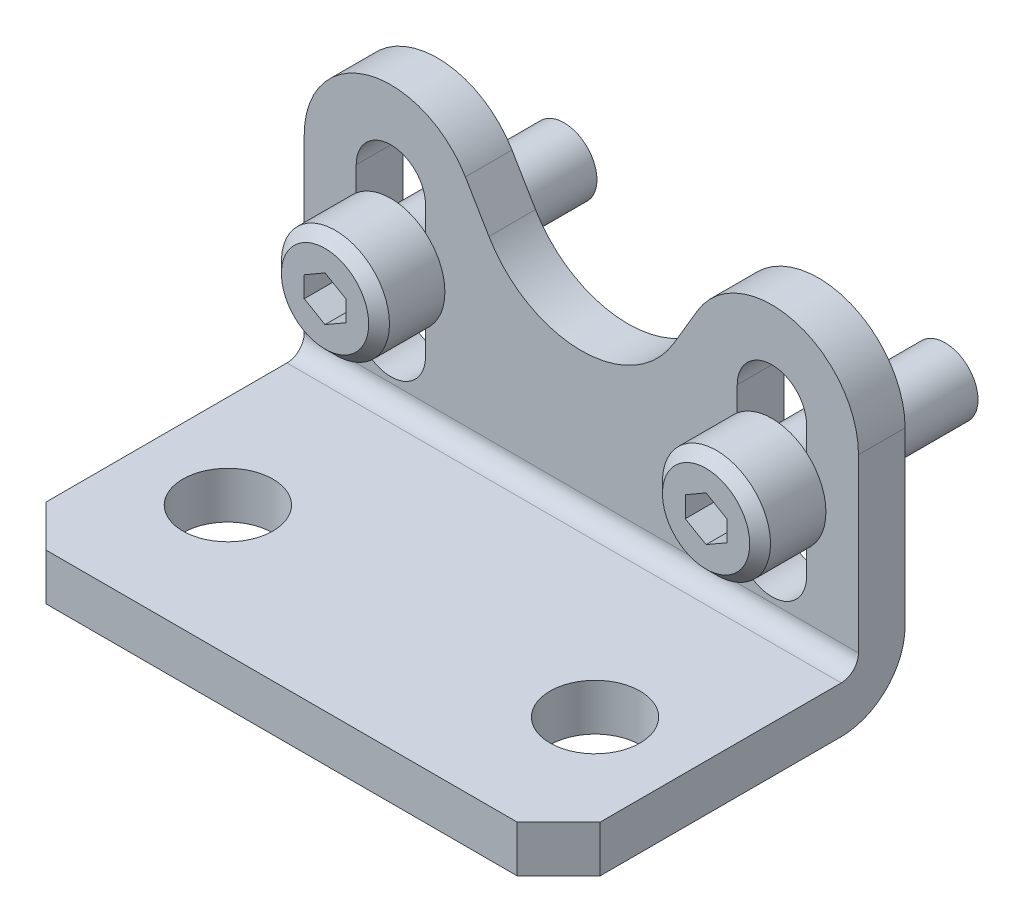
ISO-10303-21;
HEADER;
FILE_DESCRIPTION(('STEP AP214'),'2;1');
FILE_NAME('part.step','',(''),(''),'','','');
FILE_SCHEMA(('AUTOMOTIVE_DESIGN { 1 0 10303 214 1 1 1 1 }'));
ENDSEC;
DATA;
#1=APPLICATION_CONTEXT('core data for automotive mechanical design processes');
#2=APPLICATION_PROTOCOL_DEFINITION('international standard','automotive_design',2000,#1);
#3=PRODUCT_CONTEXT('',#1,'mechanical');
#4=PRODUCT('Part','Part','',(#3));
#5=PRODUCT_RELATED_PRODUCT_CATEGORY('part','',(#4));
#6=PRODUCT_DEFINITION_FORMATION('','',#4);
#7=PRODUCT_DEFINITION_CONTEXT('part definition',#1,'design');
#8=PRODUCT_DEFINITION('design','',#6,#7);
#9=PRODUCT_DEFINITION_SHAPE('','',#8);
#10=(LENGTH_UNIT() NAMED_UNIT(*) SI_UNIT(.MILLI.,.METRE.));
#11=(NAMED_UNIT(*) PLANE_ANGLE_UNIT() SI_UNIT($,.RADIAN.));
#12=(NAMED_UNIT(*) SI_UNIT($,.STERADIAN.) SOLID_ANGLE_UNIT());
#13=UNCERTAINTY_MEASURE_WITH_UNIT(LENGTH_MEASURE(1.E-05),#10,'distance_accuracy_value','');
#14=(GEOMETRIC_REPRESENTATION_CONTEXT(3) GLOBAL_UNCERTAINTY_ASSIGNED_CONTEXT((#13)) GLOBAL_UNIT_ASSIGNED_CONTEXT((#10,
#11,#12)) REPRESENTATION_CONTEXT('',''));
#15=CARTESIAN_POINT('',(0.,0.,0.));
#16=DIRECTION('',(0.,0.,1.));
#17=DIRECTION('',(1.,0.,0.));
#18=AXIS2_PLACEMENT_3D('',#15,#16,#17);
#19=CARTESIAN_POINT('',(-12.446,-11.66576362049,5.9563));
#20=DIRECTION('',(0.,0.,-1.));
#21=DIRECTION('',(-1.,0.,0.));
#22=AXIS2_PLACEMENT_3D('',#19,#20,#21);
#23=PLANE('',#22);
#24=DIRECTION('',(0.,1.,0.));
#25=VECTOR('',#24,1.);
#26=CARTESIAN_POINT('',(-12.446,-9.906,5.9563));
#27=LINE('',#26,#25);
#28=CARTESIAN_POINT('',(-12.446,-9.906,5.9563));
#29=VERTEX_POINT('',#28);
#30=CARTESIAN_POINT('',(-12.446,-8.382,5.9563));
#31=VERTEX_POINT('',#30);
#32=EDGE_CURVE('E549',#29,#31,#27,.T.);
#33=ORIENTED_EDGE('',*,*,#32,.T.);
#34=DIRECTION('',(-0.86602540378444,0.5,0.));
#35=VECTOR('',#34,1.);
#36=CARTESIAN_POINT('',(-12.446,-8.382,5.9563));
#37=LINE('',#36,#35);
#38=CARTESIAN_POINT('',(-13.97,-7.50211818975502,5.9563));
#39=VERTEX_POINT('',#38);
#40=EDGE_CURVE('E552',#31,#39,#37,.T.);
#41=ORIENTED_EDGE('',*,*,#40,.T.);
#42=DIRECTION('',(-0.86602540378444,-0.5,0.));
#43=VECTOR('',#42,1.);
#44=CARTESIAN_POINT('',(-15.494,-8.382,5.9563));
#45=LINE('',#44,#43);
#46=CARTESIAN_POINT('',(-15.494,-8.382,5.9563));
#47=VERTEX_POINT('',#46);
#48=EDGE_CURVE('E555',#39,#47,#45,.T.);
#49=ORIENTED_EDGE('',*,*,#48,.T.);
#50=DIRECTION('',(0.,-1.,0.));
#51=VECTOR('',#50,1.);
#52=CARTESIAN_POINT('',(-15.494,-9.906,5.9563));
#53=LINE('',#52,#51);
#54=CARTESIAN_POINT('',(-15.494,-9.906,5.9563));
#55=VERTEX_POINT('',#54);
#56=EDGE_CURVE('E558',#47,#55,#53,.T.);
#57=ORIENTED_EDGE('',*,*,#56,.T.);
#58=DIRECTION('',(0.86602540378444,-0.5,0.));
#59=VECTOR('',#58,1.);
#60=CARTESIAN_POINT('',(-15.494,-9.906,5.9563));
#61=LINE('',#60,#59);
#62=CARTESIAN_POINT('',(-13.97,-10.785881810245,5.9563));
#63=VERTEX_POINT('',#62);
#64=EDGE_CURVE('E561',#55,#63,#61,.T.);
#65=ORIENTED_EDGE('',*,*,#64,.T.);
#66=DIRECTION('',(0.86602540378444,0.5,0.));
#67=VECTOR('',#66,1.);
#68=CARTESIAN_POINT('',(-12.446,-9.906,5.9563));
#69=LINE('',#68,#67);
#70=EDGE_CURVE('E564',#63,#29,#69,.T.);
#71=ORIENTED_EDGE('',*,*,#70,.T.);
#72=EDGE_LOOP('',(#33,#41,#49,#57,#65,#71));
#73=FACE_BOUND('',#72,.T.);
#74=ADVANCED_FACE('F14',(#73),#23,.F.);
#75=CARTESIAN_POINT('',(-15.494,-8.382,5.9563));
#76=DIRECTION('',(-0.5,0.86602540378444,0.));
#77=DIRECTION('',(-0.86602540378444,-0.5,0.));
#78=AXIS2_PLACEMENT_3D('',#75,#76,#77);
#79=PLANE('',#78);
#80=DIRECTION('',(-0.86602540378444,-0.5,0.));
#81=VECTOR('',#80,1.);
#82=CARTESIAN_POINT('',(-15.494,-8.382,8.2423));
#83=LINE('',#82,#81);
#84=CARTESIAN_POINT('',(-13.97,-7.50211818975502,8.2423));
#85=VERTEX_POINT('',#84);
#86=CARTESIAN_POINT('',(-15.494,-8.382,8.2423));
#87=VERTEX_POINT('',#86);
#88=EDGE_CURVE('E537',#85,#87,#83,.T.);
#89=ORIENTED_EDGE('',*,*,#88,.T.);
#90=DIRECTION('',(0.,0.,1.));
#91=VECTOR('',#90,1.);
#92=CARTESIAN_POINT('',(-15.494,-8.382,5.9563));
#93=LINE('',#92,#91);
#94=EDGE_CURVE('E575',#47,#87,#93,.T.);
#95=ORIENTED_EDGE('',*,*,#94,.F.);
#96=ORIENTED_EDGE('',*,*,#48,.F.);
#97=DIRECTION('',(0.,0.,1.));
#98=VECTOR('',#97,1.);
#99=CARTESIAN_POINT('',(-13.97,-7.50211818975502,5.9563));
#100=LINE('',#99,#98);
#101=EDGE_CURVE('E577',#39,#85,#100,.T.);
#102=ORIENTED_EDGE('',*,*,#101,.T.);
#103=EDGE_LOOP('',(#89,#95,#96,#102));
#104=FACE_BOUND('',#103,.T.);
#105=ADVANCED_FACE('F643',(#104),#79,.F.);
#106=CARTESIAN_POINT('',(-15.494,-9.906,5.9563));
#107=DIRECTION('',(-1.,0.,0.));
#108=DIRECTION('',(0.,-1.,0.));
#109=AXIS2_PLACEMENT_3D('',#106,#107,#108);
#110=PLANE('',#109);
#111=DIRECTION('',(0.,-1.,0.));
#112=VECTOR('',#111,1.);
#113=CARTESIAN_POINT('',(-15.494,-9.906,8.2423));
#114=LINE('',#113,#112);
#115=CARTESIAN_POINT('',(-15.494,-9.906,8.2423));
#116=VERTEX_POINT('',#115);
#117=EDGE_CURVE('E540',#87,#116,#114,.T.);
#118=ORIENTED_EDGE('',*,*,#117,.T.);
#119=DIRECTION('',(0.,0.,1.));
#120=VECTOR('',#119,1.);
#121=CARTESIAN_POINT('',(-15.494,-9.906,5.9563));
#122=LINE('',#121,#120);
#123=EDGE_CURVE('E573',#55,#116,#122,.T.);
#124=ORIENTED_EDGE('',*,*,#123,.F.);
#125=ORIENTED_EDGE('',*,*,#56,.F.);
#126=ORIENTED_EDGE('',*,*,#94,.T.);
#127=EDGE_LOOP('',(#118,#124,#125,#126));
#128=FACE_BOUND('',#127,.T.);
#129=ADVANCED_FACE('F649',(#128),#110,.F.);
#130=CARTESIAN_POINT('',(-15.494,-9.906,5.9563));
#131=DIRECTION('',(-0.5,-0.86602540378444,0.));
#132=DIRECTION('',(0.86602540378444,-0.5,0.));
#133=AXIS2_PLACEMENT_3D('',#130,#131,#132);
#134=PLANE('',#133);
#135=DIRECTION('',(0.86602540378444,-0.5,0.));
#136=VECTOR('',#135,1.);
#137=CARTESIAN_POINT('',(-15.494,-9.906,8.2423));
#138=LINE('',#137,#136);
#139=CARTESIAN_POINT('',(-13.97,-10.785881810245,8.2423));
#140=VERTEX_POINT('',#139);
#141=EDGE_CURVE('E543',#116,#140,#138,.T.);
#142=ORIENTED_EDGE('',*,*,#141,.T.);
#143=DIRECTION('',(0.,0.,1.));
#144=VECTOR('',#143,1.);
#145=CARTESIAN_POINT('',(-13.97,-10.785881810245,5.9563));
#146=LINE('',#145,#144);
#147=EDGE_CURVE('E571',#63,#140,#146,.T.);
#148=ORIENTED_EDGE('',*,*,#147,.F.);
#149=ORIENTED_EDGE('',*,*,#64,.F.);
#150=ORIENTED_EDGE('',*,*,#123,.T.);
#151=EDGE_LOOP('',(#142,#148,#149,#150));
#152=FACE_BOUND('',#151,.T.);
#153=ADVANCED_FACE('F659',(#152),#134,.F.);
#154=CARTESIAN_POINT('',(-12.446,-9.906,5.9563));
#155=DIRECTION('',(0.5,-0.86602540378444,0.));
#156=DIRECTION('',(0.86602540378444,0.5,0.));
#157=AXIS2_PLACEMENT_3D('',#154,#155,#156);
#158=PLANE('',#157);
#159=DIRECTION('',(0.86602540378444,0.5,0.));
#160=VECTOR('',#159,1.);
#161=CARTESIAN_POINT('',(-12.446,-9.906,8.2423));
#162=LINE('',#161,#160);
#163=CARTESIAN_POINT('',(-12.446,-9.906,8.2423));
#164=VERTEX_POINT('',#163);
#165=EDGE_CURVE('E546',#140,#164,#162,.T.);
#166=ORIENTED_EDGE('',*,*,#165,.T.);
#167=DIRECTION('',(0.,0.,1.));
#168=VECTOR('',#167,1.);
#169=CARTESIAN_POINT('',(-12.446,-9.906,5.9563));
#170=LINE('',#169,#168);
#171=EDGE_CURVE('E568',#29,#164,#170,.T.);
#172=ORIENTED_EDGE('',*,*,#171,.F.);
#173=ORIENTED_EDGE('',*,*,#70,.F.);
#174=ORIENTED_EDGE('',*,*,#147,.T.);
#175=EDGE_LOOP('',(#166,#172,#173,#174));
#176=FACE_BOUND('',#175,.T.);
#177=ADVANCED_FACE('F655',(#176),#158,.F.);
#178=CARTESIAN_POINT('',(-12.446,-9.906,5.9563));
#179=DIRECTION('',(1.,0.,0.));
#180=DIRECTION('',(0.,1.,0.));
#181=AXIS2_PLACEMENT_3D('',#178,#179,#180);
#182=PLANE('',#181);
#183=DIRECTION('',(0.,1.,0.));
#184=VECTOR('',#183,1.);
#185=CARTESIAN_POINT('',(-12.446,-9.906,8.2423));
#186=LINE('',#185,#184);
#187=CARTESIAN_POINT('',(-12.446,-8.382,8.2423));
#188=VERTEX_POINT('',#187);
#189=EDGE_CURVE('E531',#164,#188,#186,.T.);
#190=ORIENTED_EDGE('',*,*,#189,.T.);
#191=DIRECTION('',(0.,0.,1.));
#192=VECTOR('',#191,1.);
#193=CARTESIAN_POINT('',(-12.446,-8.382,5.9563));
#194=LINE('',#193,#192);
#195=EDGE_CURVE('E567',#31,#188,#194,.T.);
#196=ORIENTED_EDGE('',*,*,#195,.F.);
#197=ORIENTED_EDGE('',*,*,#32,.F.);
#198=ORIENTED_EDGE('',*,*,#171,.T.);
#199=EDGE_LOOP('',(#190,#196,#197,#198));
#200=FACE_BOUND('',#199,.T.);
#201=ADVANCED_FACE('F658',(#200),#182,.F.);
#202=CARTESIAN_POINT('',(-12.446,-8.382,5.9563));
#203=DIRECTION('',(0.5,0.86602540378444,0.));
#204=DIRECTION('',(-0.86602540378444,0.5,0.));
#205=AXIS2_PLACEMENT_3D('',#202,#203,#204);
#206=PLANE('',#205);
#207=DIRECTION('',(-0.86602540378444,0.5,0.));
#208=VECTOR('',#207,1.);
#209=CARTESIAN_POINT('',(-12.446,-8.382,8.2423));
#210=LINE('',#209,#208);
#211=EDGE_CURVE('E533',#188,#85,#210,.T.);
#212=ORIENTED_EDGE('',*,*,#211,.T.);
#213=ORIENTED_EDGE('',*,*,#101,.F.);
#214=ORIENTED_EDGE('',*,*,#40,.F.);
#215=ORIENTED_EDGE('',*,*,#195,.T.);
#216=EDGE_LOOP('',(#212,#213,#214,#215));
#217=FACE_BOUND('',#216,.T.);
#218=ADVANCED_FACE('F667',(#217),#206,.F.);
#219=CARTESIAN_POINT('',(-13.97,-9.144,8.2423));
#220=DIRECTION('',(0.,0.,-1.));
#221=DIRECTION('',(-1.,0.,0.));
#222=AXIS2_PLACEMENT_3D('',#219,#220,#221);
#223=PLANE('',#222);
#224=ORIENTED_EDGE('',*,*,#211,.F.);
#225=ORIENTED_EDGE('',*,*,#189,.F.);
#226=ORIENTED_EDGE('',*,*,#165,.F.);
#227=ORIENTED_EDGE('',*,*,#141,.F.);
#228=ORIENTED_EDGE('',*,*,#117,.F.);
#229=ORIENTED_EDGE('',*,*,#88,.F.);
#230=EDGE_LOOP('',(#224,#225,#226,#227,#228,#229));
#231=FACE_BOUND('',#230,.T.);
#232=CARTESIAN_POINT('',(-13.97,-9.144,8.2423));
#233=DIRECTION('',(0.,0.,1.));
#234=DIRECTION('',(1.,0.,0.));
#235=AXIS2_PLACEMENT_3D('',#232,#233,#234);
#236=CIRCLE('',#235,3.2004);
#237=CARTESIAN_POINT('',(-10.7696,-9.144,8.2423));
#238=VERTEX_POINT('',#237);
#239=EDGE_CURVE('E18',#238,#238,#236,.T.);
#240=ORIENTED_EDGE('',*,*,#239,.T.);
#241=EDGE_LOOP('',(#240));
#242=FACE_BOUND('',#241,.T.);
#243=ADVANCED_FACE('F16',(#231,#242),#223,.F.);
#244=CARTESIAN_POINT('',(-13.97,-6.731,-9.2837));
#245=DIRECTION('',(0.,0.,1.));
#246=DIRECTION('',(1.,0.,0.));
#247=AXIS2_PLACEMENT_3D('',#244,#245,#246);
#248=PLANE('',#247);
#249=CARTESIAN_POINT('',(-13.97,-9.144,-9.2837));
#250=DIRECTION('',(0.,0.,1.));
#251=DIRECTION('',(1.,0.,0.));
#252=AXIS2_PLACEMENT_3D('',#249,#250,#251);
#253=CIRCLE('',#252,2.413);
#254=CARTESIAN_POINT('',(-11.557,-9.144,-9.2837));
#255=VERTEX_POINT('',#254);
#256=EDGE_CURVE('E570',#255,#255,#253,.T.);
#257=ORIENTED_EDGE('',*,*,#256,.F.);
#258=EDGE_LOOP('',(#257));
#259=FACE_BOUND('',#258,.T.);
#260=ADVANCED_FACE('F674',(#259),#248,.F.);
#261=CARTESIAN_POINT('',(-13.97,-9.144,7.4803));
#262=DIRECTION('',(0.,0.,-1.));
#263=DIRECTION('',(-1.,0.,0.));
#264=AXIS2_PLACEMENT_3D('',#261,#262,#263);
#265=CONICAL_SURFACE('',#264,3.9624,0.78539816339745);
#266=ORIENTED_EDGE('',*,*,#239,.F.);
#267=EDGE_LOOP('',(#266));
#268=FACE_BOUND('',#267,.T.);
#269=CARTESIAN_POINT('',(-13.97,-9.144,7.4803));
#270=DIRECTION('',(0.,0.,1.));
#271=DIRECTION('',(1.,0.,0.));
#272=AXIS2_PLACEMENT_3D('',#269,#270,#271);
#273=CIRCLE('',#272,3.9624);
#274=CARTESIAN_POINT('',(-10.0076,-9.144,7.4803));
#275=VERTEX_POINT('',#274);
#276=EDGE_CURVE('E587',#275,#275,#273,.T.);
#277=ORIENTED_EDGE('',*,*,#276,.T.);
#278=EDGE_LOOP('',(#277));
#279=FACE_BOUND('',#278,.T.);
#280=ADVANCED_FACE('F677',(#268,#279),#265,.T.);
#281=CARTESIAN_POINT('',(-13.97,-9.144,8.2423));
#282=DIRECTION('',(0.,0.,1.));
#283=DIRECTION('',(1.,0.,0.));
#284=AXIS2_PLACEMENT_3D('',#281,#282,#283);
#285=CYLINDRICAL_SURFACE('',#284,2.413);
#286=CARTESIAN_POINT('',(-13.97,-9.144,3.4163));
#287=DIRECTION('',(0.,0.,1.));
#288=DIRECTION('',(1.,0.,0.));
#289=AXIS2_PLACEMENT_3D('',#286,#287,#288);
#290=CIRCLE('',#289,2.413);
#291=CARTESIAN_POINT('',(-11.557,-9.144,3.4163));
#292=VERTEX_POINT('',#291);
#293=EDGE_CURVE('E583',#292,#292,#290,.T.);
#294=ORIENTED_EDGE('',*,*,#293,.F.);
#295=EDGE_LOOP('',(#294));
#296=FACE_BOUND('',#295,.T.);
#297=ORIENTED_EDGE('',*,*,#256,.T.);
#298=EDGE_LOOP('',(#297));
#299=FACE_BOUND('',#298,.T.);
#300=ADVANCED_FACE('F679',(#296,#299),#285,.T.);
#301=CARTESIAN_POINT('',(-13.97,-9.144,8.2423));
#302=DIRECTION('',(0.,0.,1.));
#303=DIRECTION('',(1.,0.,0.));
#304=AXIS2_PLACEMENT_3D('',#301,#302,#303);
#305=CYLINDRICAL_SURFACE('',#304,3.9624);
#306=ORIENTED_EDGE('',*,*,#276,.F.);
#307=EDGE_LOOP('',(#306));
#308=FACE_BOUND('',#307,.T.);
#309=CARTESIAN_POINT('',(-13.97,-9.144,3.4163));
#310=DIRECTION('',(0.,0.,1.));
#311=DIRECTION('',(1.,0.,0.));
#312=AXIS2_PLACEMENT_3D('',#309,#310,#311);
#313=CIRCLE('',#312,3.9624);
#314=CARTESIAN_POINT('',(-11.43,-6.10278087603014,3.4163));
#315=VERTEX_POINT('',#314);
#316=CARTESIAN_POINT('',(-16.51,-6.10278087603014,3.4163));
#317=VERTEX_POINT('',#316);
#318=EDGE_CURVE('E586',#315,#317,#313,.T.);
#319=ORIENTED_EDGE('',*,*,#318,.T.);
#320=CARTESIAN_POINT('',(-16.51,-12.1852191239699,3.4163));
#321=VERTEX_POINT('',#320);
#322=EDGE_CURVE('E41',#317,#321,#313,.T.);
#323=ORIENTED_EDGE('',*,*,#322,.T.);
#324=CARTESIAN_POINT('',(-11.43,-12.1852191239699,3.4163));
#325=VERTEX_POINT('',#324);
#326=EDGE_CURVE('E617',#321,#325,#313,.T.);
#327=ORIENTED_EDGE('',*,*,#326,.T.);
#328=EDGE_CURVE('E33',#325,#315,#313,.T.);
#329=ORIENTED_EDGE('',*,*,#328,.T.);
#330=EDGE_LOOP('',(#319,#323,#327,#329));
#331=FACE_BOUND('',#330,.T.);
#332=ADVANCED_FACE('F620',(#308,#331),#305,.T.);
#333=CARTESIAN_POINT('',(-13.97,-5.1816,3.4163));
#334=DIRECTION('',(0.,0.,1.));
#335=DIRECTION('',(1.,0.,0.));
#336=AXIS2_PLACEMENT_3D('',#333,#334,#335);
#337=PLANE('',#336);
#338=ORIENTED_EDGE('',*,*,#326,.F.);
#339=DIRECTION('',(0.,1.,0.));
#340=VECTOR('',#339,1.);
#341=CARTESIAN_POINT('',(-16.51,-4.318,3.4163));
#342=LINE('',#341,#340);
#343=EDGE_CURVE('E9',#321,#317,#342,.T.);
#344=ORIENTED_EDGE('',*,*,#343,.T.);
#345=ORIENTED_EDGE('',*,*,#318,.F.);
#346=DIRECTION('',(0.,-1.,0.));
#347=VECTOR('',#346,1.);
#348=CARTESIAN_POINT('',(-11.43,-4.318,3.4163));
#349=LINE('',#348,#347);
#350=EDGE_CURVE('E23',#315,#325,#349,.T.);
#351=ORIENTED_EDGE('',*,*,#350,.T.);
#352=EDGE_LOOP('',(#338,#344,#345,#351));
#353=FACE_BOUND('',#352,.T.);
#354=ORIENTED_EDGE('',*,*,#293,.T.);
#355=EDGE_LOOP('',(#354));
#356=FACE_BOUND('',#355,.T.);
#357=ADVANCED_FACE('F618',(#353,#356),#337,.F.);
#358=CARTESIAN_POINT('',(15.494,-11.66576362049,5.9563));
#359=DIRECTION('',(0.,0.,-1.));
#360=DIRECTION('',(-1.,0.,0.));
#361=AXIS2_PLACEMENT_3D('',#358,#359,#360);
#362=PLANE('',#361);
#363=DIRECTION('',(0.,1.,0.));
#364=VECTOR('',#363,1.);
#365=CARTESIAN_POINT('',(15.494,-9.906,5.9563));
#366=LINE('',#365,#364);
#367=CARTESIAN_POINT('',(15.494,-9.906,5.9563));
#368=VERTEX_POINT('',#367);
#369=CARTESIAN_POINT('',(15.494,-8.382,5.9563));
#370=VERTEX_POINT('',#369);
#371=EDGE_CURVE('E301',#368,#370,#366,.T.);
#372=ORIENTED_EDGE('',*,*,#371,.T.);
#373=DIRECTION('',(-0.86602540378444,0.5,0.));
#374=VECTOR('',#373,1.);
#375=CARTESIAN_POINT('',(15.494,-8.382,5.9563));
#376=LINE('',#375,#374);
#377=CARTESIAN_POINT('',(13.97,-7.50211818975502,5.9563));
#378=VERTEX_POINT('',#377);
#379=EDGE_CURVE('E304',#370,#378,#376,.T.);
#380=ORIENTED_EDGE('',*,*,#379,.T.);
#381=DIRECTION('',(-0.86602540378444,-0.5,0.));
#382=VECTOR('',#381,1.);
#383=CARTESIAN_POINT('',(12.446,-8.382,5.9563));
#384=LINE('',#383,#382);
#385=CARTESIAN_POINT('',(12.446,-8.382,5.9563));
#386=VERTEX_POINT('',#385);
#387=EDGE_CURVE('E271',#378,#386,#384,.T.);
#388=ORIENTED_EDGE('',*,*,#387,.T.);
#389=DIRECTION('',(0.,-1.,0.));
#390=VECTOR('',#389,1.);
#391=CARTESIAN_POINT('',(12.446,-9.906,5.9563));
#392=LINE('',#391,#390);
#393=CARTESIAN_POINT('',(12.446,-9.906,5.9563));
#394=VERTEX_POINT('',#393);
#395=EDGE_CURVE('E307',#386,#394,#392,.T.);
#396=ORIENTED_EDGE('',*,*,#395,.T.);
#397=DIRECTION('',(0.86602540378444,-0.5,0.));
#398=VECTOR('',#397,1.);
#399=CARTESIAN_POINT('',(12.446,-9.906,5.9563));
#400=LINE('',#399,#398);
#401=CARTESIAN_POINT('',(13.97,-10.785881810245,5.9563));
#402=VERTEX_POINT('',#401);
#403=EDGE_CURVE('E310',#394,#402,#400,.T.);
#404=ORIENTED_EDGE('',*,*,#403,.T.);
#405=DIRECTION('',(0.86602540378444,0.5,0.));
#406=VECTOR('',#405,1.);
#407=CARTESIAN_POINT('',(15.494,-9.906,5.9563));
#408=LINE('',#407,#406);
#409=EDGE_CURVE('E313',#402,#368,#408,.T.);
#410=ORIENTED_EDGE('',*,*,#409,.T.);
#411=EDGE_LOOP('',(#372,#380,#388,#396,#404,#410));
#412=FACE_BOUND('',#411,.T.);
#413=ADVANCED_FACE('F685',(#412),#362,.F.);
#414=CARTESIAN_POINT('',(13.97,-6.731,-9.2837));
#415=DIRECTION('',(0.,0.,1.));
#416=DIRECTION('',(1.,0.,0.));
#417=AXIS2_PLACEMENT_3D('',#414,#415,#416);
#418=PLANE('',#417);
#419=CARTESIAN_POINT('',(13.97,-9.144,-9.2837));
#420=DIRECTION('',(0.,0.,1.));
#421=DIRECTION('',(1.,0.,0.));
#422=AXIS2_PLACEMENT_3D('',#419,#420,#421);
#423=CIRCLE('',#422,2.413);
#424=CARTESIAN_POINT('',(16.383,-9.144,-9.2837));
#425=VERTEX_POINT('',#424);
#426=EDGE_CURVE('E318',#425,#425,#423,.T.);
#427=ORIENTED_EDGE('',*,*,#426,.F.);
#428=EDGE_LOOP('',(#427));
#429=FACE_BOUND('',#428,.T.);
#430=ADVANCED_FACE('F717',(#429),#418,.F.);
#431=CARTESIAN_POINT('',(12.446,-8.382,5.9563));
#432=DIRECTION('',(-0.5,0.86602540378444,0.));
#433=DIRECTION('',(-0.86602540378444,-0.5,0.));
#434=AXIS2_PLACEMENT_3D('',#431,#432,#433);
#435=PLANE('',#434);
#436=DIRECTION('',(-0.86602540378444,-0.5,0.));
#437=VECTOR('',#436,1.);
#438=CARTESIAN_POINT('',(12.446,-8.382,8.2423));
#439=LINE('',#438,#437);
#440=CARTESIAN_POINT('',(13.97,-7.50211818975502,8.2423));
#441=VERTEX_POINT('',#440);
#442=CARTESIAN_POINT('',(12.446,-8.382,8.2423));
#443=VERTEX_POINT('',#442);
#444=EDGE_CURVE('E268',#441,#443,#439,.T.);
#445=ORIENTED_EDGE('',*,*,#444,.T.);
#446=DIRECTION('',(0.,0.,1.));
#447=VECTOR('',#446,1.);
#448=CARTESIAN_POINT('',(12.446,-8.382,5.9563));
#449=LINE('',#448,#447);
#450=EDGE_CURVE('E275',#386,#443,#449,.T.);
#451=ORIENTED_EDGE('',*,*,#450,.F.);
#452=ORIENTED_EDGE('',*,*,#387,.F.);
#453=DIRECTION('',(0.,0.,1.));
#454=VECTOR('',#453,1.);
#455=CARTESIAN_POINT('',(13.97,-7.50211818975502,5.9563));
#456=LINE('',#455,#454);
#457=EDGE_CURVE('E264',#378,#441,#456,.T.);
#458=ORIENTED_EDGE('',*,*,#457,.T.);
#459=EDGE_LOOP('',(#445,#451,#452,#458));
#460=FACE_BOUND('',#459,.T.);
#461=ADVANCED_FACE('F266',(#460),#435,.F.);
#462=CARTESIAN_POINT('',(12.446,-9.906,5.9563));
#463=DIRECTION('',(-1.,0.,0.));
#464=DIRECTION('',(0.,-1.,0.));
#465=AXIS2_PLACEMENT_3D('',#462,#463,#464);
#466=PLANE('',#465);
#467=DIRECTION('',(0.,-1.,0.));
#468=VECTOR('',#467,1.);
#469=CARTESIAN_POINT('',(12.446,-9.906,8.2423));
#470=LINE('',#469,#468);
#471=CARTESIAN_POINT('',(12.446,-9.906,8.2423));
#472=VERTEX_POINT('',#471);
#473=EDGE_CURVE('E290',#443,#472,#470,.T.);
#474=ORIENTED_EDGE('',*,*,#473,.T.);
#475=DIRECTION('',(0.,0.,1.));
#476=VECTOR('',#475,1.);
#477=CARTESIAN_POINT('',(12.446,-9.906,5.9563));
#478=LINE('',#477,#476);
#479=EDGE_CURVE('E321',#394,#472,#478,.T.);
#480=ORIENTED_EDGE('',*,*,#479,.F.);
#481=ORIENTED_EDGE('',*,*,#395,.F.);
#482=ORIENTED_EDGE('',*,*,#450,.T.);
#483=EDGE_LOOP('',(#474,#480,#481,#482));
#484=FACE_BOUND('',#483,.T.);
#485=ADVANCED_FACE('F735',(#484),#466,.F.);
#486=CARTESIAN_POINT('',(12.446,-9.906,5.9563));
#487=DIRECTION('',(-0.5,-0.86602540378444,0.));
#488=DIRECTION('',(0.86602540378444,-0.5,0.));
#489=AXIS2_PLACEMENT_3D('',#486,#487,#488);
#490=PLANE('',#489);
#491=DIRECTION('',(0.86602540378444,-0.5,0.));
#492=VECTOR('',#491,1.);
#493=CARTESIAN_POINT('',(12.446,-9.906,8.2423));
#494=LINE('',#493,#492);
#495=CARTESIAN_POINT('',(13.97,-10.785881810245,8.2423));
#496=VERTEX_POINT('',#495);
#497=EDGE_CURVE('E292',#472,#496,#494,.T.);
#498=ORIENTED_EDGE('',*,*,#497,.T.);
#499=DIRECTION('',(0.,0.,1.));
#500=VECTOR('',#499,1.);
#501=CARTESIAN_POINT('',(13.97,-10.785881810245,5.9563));
#502=LINE('',#501,#500);
#503=EDGE_CURVE('E319',#402,#496,#502,.T.);
#504=ORIENTED_EDGE('',*,*,#503,.F.);
#505=ORIENTED_EDGE('',*,*,#403,.F.);
#506=ORIENTED_EDGE('',*,*,#479,.T.);
#507=EDGE_LOOP('',(#498,#504,#505,#506));
#508=FACE_BOUND('',#507,.T.);
#509=ADVANCED_FACE('F742',(#508),#490,.F.);
#510=CARTESIAN_POINT('',(15.494,-9.906,5.9563));
#511=DIRECTION('',(0.5,-0.86602540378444,0.));
#512=DIRECTION('',(0.86602540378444,0.5,0.));
#513=AXIS2_PLACEMENT_3D('',#510,#511,#512);
#514=PLANE('',#513);
#515=DIRECTION('',(0.86602540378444,0.5,0.));
#516=VECTOR('',#515,1.);
#517=CARTESIAN_POINT('',(15.494,-9.906,8.2423));
#518=LINE('',#517,#516);
#519=CARTESIAN_POINT('',(15.494,-9.906,8.2423));
#520=VERTEX_POINT('',#519);
#521=EDGE_CURVE('E298',#496,#520,#518,.T.);
#522=ORIENTED_EDGE('',*,*,#521,.T.);
#523=DIRECTION('',(0.,0.,1.));
#524=VECTOR('',#523,1.);
#525=CARTESIAN_POINT('',(15.494,-9.906,5.9563));
#526=LINE('',#525,#524);
#527=EDGE_CURVE('E316',#368,#520,#526,.T.);
#528=ORIENTED_EDGE('',*,*,#527,.F.);
#529=ORIENTED_EDGE('',*,*,#409,.F.);
#530=ORIENTED_EDGE('',*,*,#503,.T.);
#531=EDGE_LOOP('',(#522,#528,#529,#530));
#532=FACE_BOUND('',#531,.T.);
#533=ADVANCED_FACE('F750',(#532),#514,.F.);
#534=CARTESIAN_POINT('',(15.494,-9.906,5.9563));
#535=DIRECTION('',(1.,0.,0.));
#536=DIRECTION('',(0.,1.,0.));
#537=AXIS2_PLACEMENT_3D('',#534,#535,#536);
#538=PLANE('',#537);
#539=DIRECTION('',(0.,1.,0.));
#540=VECTOR('',#539,1.);
#541=CARTESIAN_POINT('',(15.494,-9.906,8.2423));
#542=LINE('',#541,#540);
#543=CARTESIAN_POINT('',(15.494,-8.382,8.2423));
#544=VERTEX_POINT('',#543);
#545=EDGE_CURVE('E284',#520,#544,#542,.T.);
#546=ORIENTED_EDGE('',*,*,#545,.T.);
#547=DIRECTION('',(0.,0.,1.));
#548=VECTOR('',#547,1.);
#549=CARTESIAN_POINT('',(15.494,-8.382,5.9563));
#550=LINE('',#549,#548);
#551=EDGE_CURVE('E276',#370,#544,#550,.T.);
#552=ORIENTED_EDGE('',*,*,#551,.F.);
#553=ORIENTED_EDGE('',*,*,#371,.F.);
#554=ORIENTED_EDGE('',*,*,#527,.T.);
#555=EDGE_LOOP('',(#546,#552,#553,#554));
#556=FACE_BOUND('',#555,.T.);
#557=ADVANCED_FACE('F728',(#556),#538,.F.);
#558=CARTESIAN_POINT('',(15.494,-8.382,5.9563));
#559=DIRECTION('',(0.5,0.86602540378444,0.));
#560=DIRECTION('',(-0.86602540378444,0.5,0.));
#561=AXIS2_PLACEMENT_3D('',#558,#559,#560);
#562=PLANE('',#561);
#563=DIRECTION('',(-0.86602540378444,0.5,0.));
#564=VECTOR('',#563,1.);
#565=CARTESIAN_POINT('',(15.494,-8.382,8.2423));
#566=LINE('',#565,#564);
#567=EDGE_CURVE('E280',#544,#441,#566,.T.);
#568=ORIENTED_EDGE('',*,*,#567,.T.);
#569=ORIENTED_EDGE('',*,*,#457,.F.);
#570=ORIENTED_EDGE('',*,*,#379,.F.);
#571=ORIENTED_EDGE('',*,*,#551,.T.);
#572=EDGE_LOOP('',(#568,#569,#570,#571));
#573=FACE_BOUND('',#572,.T.);
#574=ADVANCED_FACE('F281',(#573),#562,.F.);
#575=CARTESIAN_POINT('',(13.97,-9.144,8.2423));
#576=DIRECTION('',(0.,0.,1.));
#577=DIRECTION('',(1.,0.,0.));
#578=AXIS2_PLACEMENT_3D('',#575,#576,#577);
#579=CYLINDRICAL_SURFACE('',#578,2.413);
#580=CARTESIAN_POINT('',(13.97,-9.144,3.4163));
#581=DIRECTION('',(0.,0.,1.));
#582=DIRECTION('',(1.,0.,0.));
#583=AXIS2_PLACEMENT_3D('',#580,#581,#582);
#584=CIRCLE('',#583,2.413);
#585=CARTESIAN_POINT('',(16.383,-9.144,3.4163));
#586=VERTEX_POINT('',#585);
#587=EDGE_CURVE('E327',#586,#586,#584,.T.);
#588=ORIENTED_EDGE('',*,*,#587,.F.);
#589=EDGE_LOOP('',(#588));
#590=FACE_BOUND('',#589,.T.);
#591=ORIENTED_EDGE('',*,*,#426,.T.);
#592=EDGE_LOOP('',(#591));
#593=FACE_BOUND('',#592,.T.);
#594=ADVANCED_FACE('F729',(#590,#593),#579,.T.);
#595=CARTESIAN_POINT('',(13.97,-9.144,8.2423));
#596=DIRECTION('',(0.,0.,-1.));
#597=DIRECTION('',(-1.,0.,0.));
#598=AXIS2_PLACEMENT_3D('',#595,#596,#597);
#599=PLANE('',#598);
#600=ORIENTED_EDGE('',*,*,#567,.F.);
#601=ORIENTED_EDGE('',*,*,#545,.F.);
#602=ORIENTED_EDGE('',*,*,#521,.F.);
#603=ORIENTED_EDGE('',*,*,#497,.F.);
#604=ORIENTED_EDGE('',*,*,#473,.F.);
#605=ORIENTED_EDGE('',*,*,#444,.F.);
#606=EDGE_LOOP('',(#600,#601,#602,#603,#604,#605));
#607=FACE_BOUND('',#606,.T.);
#608=CARTESIAN_POINT('',(13.97,-9.144,8.2423));
#609=DIRECTION('',(0.,0.,1.));
#610=DIRECTION('',(1.,0.,0.));
#611=AXIS2_PLACEMENT_3D('',#608,#609,#610);
#612=CIRCLE('',#611,3.2004);
#613=CARTESIAN_POINT('',(17.1704,-9.144,8.2423));
#614=VERTEX_POINT('',#613);
#615=EDGE_CURVE('E338',#614,#614,#612,.T.);
#616=ORIENTED_EDGE('',*,*,#615,.T.);
#617=EDGE_LOOP('',(#616));
#618=FACE_BOUND('',#617,.T.);
#619=ADVANCED_FACE('F286',(#607,#618),#599,.F.);
#620=CARTESIAN_POINT('',(-17.272,73.0549570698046,25.4));
#621=DIRECTION('',(0.707106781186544,0.,-0.707106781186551));
#622=DIRECTION('',(-0.707106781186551,0.,-0.707106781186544));
#623=AXIS2_PLACEMENT_3D('',#620,#621,#622);
#624=PLANE('',#623);
#625=DIRECTION('',(-0.707106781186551,0.,-0.707106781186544));
#626=VECTOR('',#625,1.);
#627=CARTESIAN_POINT('',(-11.1759999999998,-18.1737,31.496));
#628=LINE('',#627,#626);
#629=CARTESIAN_POINT('',(-20.32,-18.1737,22.352));
#630=VERTEX_POINT('',#629);
#631=CARTESIAN_POINT('',(-17.272,-18.1737,25.4));
#632=VERTEX_POINT('',#631);
#633=EDGE_CURVE('E525',#630,#632,#628,.F.);
#634=ORIENTED_EDGE('',*,*,#633,.F.);
#635=DIRECTION('',(0.,1.,0.));
#636=VECTOR('',#635,1.);
#637=CARTESIAN_POINT('',(-20.32,73.0549570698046,22.352));
#638=LINE('',#637,#636);
#639=CARTESIAN_POINT('',(-20.32,-21.59,22.352));
#640=VERTEX_POINT('',#639);
#641=EDGE_CURVE('E529',#640,#630,#638,.T.);
#642=ORIENTED_EDGE('',*,*,#641,.F.);
#643=DIRECTION('',(0.707106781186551,0.,0.707106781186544));
#644=VECTOR('',#643,1.);
#645=CARTESIAN_POINT('',(-17.272,-21.59,25.4));
#646=LINE('',#645,#644);
#647=CARTESIAN_POINT('',(-17.272,-21.59,25.4));
#648=VERTEX_POINT('',#647);
#649=EDGE_CURVE('E516',#648,#640,#646,.F.);
#650=ORIENTED_EDGE('',*,*,#649,.F.);
#651=DIRECTION('',(0.,-1.,0.));
#652=VECTOR('',#651,1.);
#653=CARTESIAN_POINT('',(-17.272,73.0549570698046,25.4));
#654=LINE('',#653,#652);
#655=EDGE_CURVE('E520',#632,#648,#654,.T.);
#656=ORIENTED_EDGE('',*,*,#655,.F.);
#657=EDGE_LOOP('',(#634,#642,#650,#656));
#658=FACE_BOUND('',#657,.T.);
#659=ADVANCED_FACE('F786',(#658),#624,.F.);
#660=CARTESIAN_POINT('',(20.32,73.0549570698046,22.352));
#661=DIRECTION('',(-0.707106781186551,0.,-0.707106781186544));
#662=DIRECTION('',(-0.707106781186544,0.,0.707106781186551));
#663=AXIS2_PLACEMENT_3D('',#660,#661,#662);
#664=PLANE('',#663);
#665=DIRECTION('',(-0.707106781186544,0.,0.707106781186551));
#666=VECTOR('',#665,1.);
#667=CARTESIAN_POINT('',(31.496,-18.1737,11.1759999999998));
#668=LINE('',#667,#666);
#669=CARTESIAN_POINT('',(17.272,-18.1737,25.4));
#670=VERTEX_POINT('',#669);
#671=CARTESIAN_POINT('',(20.32,-18.1737,22.352));
#672=VERTEX_POINT('',#671);
#673=EDGE_CURVE('E527',#670,#672,#668,.F.);
#674=ORIENTED_EDGE('',*,*,#673,.F.);
#675=DIRECTION('',(0.,1.,0.));
#676=VECTOR('',#675,1.);
#677=CARTESIAN_POINT('',(17.272,73.0549570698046,25.4));
#678=LINE('',#677,#676);
#679=CARTESIAN_POINT('',(17.272,-21.59,25.4));
#680=VERTEX_POINT('',#679);
#681=EDGE_CURVE('E523',#680,#670,#678,.T.);
#682=ORIENTED_EDGE('',*,*,#681,.F.);
#683=DIRECTION('',(0.707106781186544,0.,-0.707106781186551));
#684=VECTOR('',#683,1.);
#685=CARTESIAN_POINT('',(20.32,-21.59,22.352));
#686=LINE('',#685,#684);
#687=CARTESIAN_POINT('',(20.32,-21.59,22.352));
#688=VERTEX_POINT('',#687);
#689=EDGE_CURVE('E518',#688,#680,#686,.F.);
#690=ORIENTED_EDGE('',*,*,#689,.F.);
#691=DIRECTION('',(0.,-1.,0.));
#692=VECTOR('',#691,1.);
#693=CARTESIAN_POINT('',(20.32,73.0549570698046,22.352));
#694=LINE('',#693,#692);
#695=EDGE_CURVE('E513',#672,#688,#694,.T.);
#696=ORIENTED_EDGE('',*,*,#695,.F.);
#697=EDGE_LOOP('',(#674,#682,#690,#696));
#698=FACE_BOUND('',#697,.T.);
#699=ADVANCED_FACE('F794',(#698),#664,.F.);
#700=CARTESIAN_POINT('',(-20.32,73.0549570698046,25.4));
#701=DIRECTION('',(0.,0.,-1.));
#702=DIRECTION('',(-1.,0.,0.));
#703=AXIS2_PLACEMENT_3D('',#700,#701,#702);
#704=PLANE('',#703);
#705=DIRECTION('',(1.,0.,0.));
#706=VECTOR('',#705,1.);
#707=CARTESIAN_POINT('',(-20.32,-21.59,25.4));
#708=LINE('',#707,#706);
#709=EDGE_CURVE('E371',#648,#680,#708,.T.);
#710=ORIENTED_EDGE('',*,*,#709,.T.);
#711=ORIENTED_EDGE('',*,*,#681,.T.);
#712=DIRECTION('',(1.,0.,0.));
#713=VECTOR('',#712,1.);
#714=CARTESIAN_POINT('',(-20.32,-18.1737,25.4));
#715=LINE('',#714,#713);
#716=EDGE_CURVE('E363',#632,#670,#715,.T.);
#717=ORIENTED_EDGE('',*,*,#716,.F.);
#718=ORIENTED_EDGE('',*,*,#655,.T.);
#719=EDGE_LOOP('',(#710,#711,#717,#718));
#720=FACE_BOUND('',#719,.T.);
#721=ADVANCED_FACE('F802',(#720),#704,.F.);
#722=CARTESIAN_POINT('',(-13.462,-18.1737,15.875));
#723=DIRECTION('',(0.,-1.,0.));
#724=DIRECTION('',(0.,0.,-1.));
#725=AXIS2_PLACEMENT_3D('',#722,#723,#724);
#726=CYLINDRICAL_SURFACE('',#725,3.302);
#727=CARTESIAN_POINT('',(-13.462,-18.1737,15.875));
#728=DIRECTION('',(0.,1.,0.));
#729=DIRECTION('',(0.,0.,-1.));
#730=AXIS2_PLACEMENT_3D('',#727,#728,#729);
#731=CIRCLE('',#730,3.302);
#732=CARTESIAN_POINT('',(-13.462,-18.1737,12.573));
#733=VERTEX_POINT('',#732);
#734=EDGE_CURVE('E352',#733,#733,#731,.T.);
#735=ORIENTED_EDGE('',*,*,#734,.T.);
#736=EDGE_LOOP('',(#735));
#737=FACE_BOUND('',#736,.T.);
#738=CARTESIAN_POINT('',(-13.462,-21.59,15.875));
#739=DIRECTION('',(0.,1.,0.));
#740=DIRECTION('',(0.,0.,-1.));
#741=AXIS2_PLACEMENT_3D('',#738,#739,#740);
#742=CIRCLE('',#741,3.302);
#743=CARTESIAN_POINT('',(-13.462,-21.59,12.573));
#744=VERTEX_POINT('',#743);
#745=EDGE_CURVE('E366',#744,#744,#742,.T.);
#746=ORIENTED_EDGE('',*,*,#745,.F.);
#747=EDGE_LOOP('',(#746));
#748=FACE_BOUND('',#747,.T.);
#749=ADVANCED_FACE('F810',(#737,#748),#726,.F.);
#750=CARTESIAN_POINT('',(13.462,-18.1737,15.875));
#751=DIRECTION('',(0.,-1.,0.));
#752=DIRECTION('',(0.,0.,-1.));
#753=AXIS2_PLACEMENT_3D('',#750,#751,#752);
#754=CYLINDRICAL_SURFACE('',#753,3.302);
#755=CARTESIAN_POINT('',(13.462,-18.1737,15.875));
#756=DIRECTION('',(0.,1.,0.));
#757=DIRECTION('',(0.,0.,1.));
#758=AXIS2_PLACEMENT_3D('',#755,#756,#757);
#759=CIRCLE('',#758,3.302);
#760=CARTESIAN_POINT('',(13.462,-18.1737,19.177));
#761=VERTEX_POINT('',#760);
#762=EDGE_CURVE('E355',#761,#761,#759,.T.);
#763=ORIENTED_EDGE('',*,*,#762,.T.);
#764=EDGE_LOOP('',(#763));
#765=FACE_BOUND('',#764,.T.);
#766=CARTESIAN_POINT('',(13.462,-21.59,15.875));
#767=DIRECTION('',(0.,1.,0.));
#768=DIRECTION('',(0.,0.,1.));
#769=AXIS2_PLACEMENT_3D('',#766,#767,#768);
#770=CIRCLE('',#769,3.302);
#771=CARTESIAN_POINT('',(13.462,-21.59,19.177));
#772=VERTEX_POINT('',#771);
#773=EDGE_CURVE('E377',#772,#772,#770,.T.);
#774=ORIENTED_EDGE('',*,*,#773,.F.);
#775=EDGE_LOOP('',(#774));
#776=FACE_BOUND('',#775,.T.);
#777=ADVANCED_FACE('F818',(#765,#776),#754,.F.);
#778=CARTESIAN_POINT('',(20.32,73.0549570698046,25.4));
#779=DIRECTION('',(-1.,0.,0.));
#780=DIRECTION('',(0.,0.,1.));
#781=AXIS2_PLACEMENT_3D('',#778,#779,#780);
#782=PLANE('',#781);
#783=DIRECTION('',(0.,0.,-1.));
#784=VECTOR('',#783,1.);
#785=CARTESIAN_POINT('',(20.32,-18.1737,25.4));
#786=LINE('',#785,#784);
#787=CARTESIAN_POINT('',(20.32,-18.1737,4.6863));
#788=VERTEX_POINT('',#787);
#789=EDGE_CURVE('E358',#672,#788,#786,.T.);
#790=ORIENTED_EDGE('',*,*,#789,.F.);
#791=ORIENTED_EDGE('',*,*,#695,.T.);
#792=DIRECTION('',(0.,0.,-1.));
#793=VECTOR('',#792,1.);
#794=CARTESIAN_POINT('',(20.32,-21.59,25.4));
#795=LINE('',#794,#793);
#796=CARTESIAN_POINT('',(20.32,-21.59,4.6863));
#797=VERTEX_POINT('',#796);
#798=EDGE_CURVE('E369',#688,#797,#795,.T.);
#799=ORIENTED_EDGE('',*,*,#798,.T.);
#800=CARTESIAN_POINT('',(20.32,-16.9037,4.6863));
#801=DIRECTION('',(-1.,0.,0.));
#802=DIRECTION('',(0.,0.,1.));
#803=AXIS2_PLACEMENT_3D('',#800,#801,#802);
#804=CIRCLE('',#803,4.6863);
#805=CARTESIAN_POINT('',(20.32,-16.9037,0.));
#806=VERTEX_POINT('',#805);
#807=EDGE_CURVE('E347',#806,#797,#804,.T.);
#808=ORIENTED_EDGE('',*,*,#807,.F.);
#809=DIRECTION('',(0.,-1.,0.));
#810=VECTOR('',#809,1.);
#811=CARTESIAN_POINT('',(20.32,-18.1737,0.));
#812=LINE('',#811,#810);
#813=CARTESIAN_POINT('',(20.32,-4.318,0.));
#814=VERTEX_POINT('',#813);
#815=EDGE_CURVE('E450',#814,#806,#812,.T.);
#816=ORIENTED_EDGE('',*,*,#815,.F.);
#817=DIRECTION('',(0.,0.,-1.));
#818=VECTOR('',#817,1.);
#819=CARTESIAN_POINT('',(20.32,-4.318,93.0861463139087));
#820=LINE('',#819,#818);
#821=CARTESIAN_POINT('',(20.32,-4.318,3.4163));
#822=VERTEX_POINT('',#821);
#823=EDGE_CURVE('E510',#822,#814,#820,.T.);
#824=ORIENTED_EDGE('',*,*,#823,.F.);
#825=DIRECTION('',(0.,-1.,0.));
#826=VECTOR('',#825,1.);
#827=CARTESIAN_POINT('',(20.32,-21.59,3.4163));
#828=LINE('',#827,#826);
#829=CARTESIAN_POINT('',(20.32,-16.9037,3.4163));
#830=VERTEX_POINT('',#829);
#831=EDGE_CURVE('E385',#822,#830,#828,.T.);
#832=ORIENTED_EDGE('',*,*,#831,.T.);
#833=CARTESIAN_POINT('',(20.32,-16.9037,4.6863));
#834=DIRECTION('',(-1.,0.,0.));
#835=DIRECTION('',(0.,0.,1.));
#836=AXIS2_PLACEMENT_3D('',#833,#834,#835);
#837=CIRCLE('',#836,1.27);
#838=EDGE_CURVE('E341',#830,#788,#837,.T.);
#839=ORIENTED_EDGE('',*,*,#838,.T.);
#840=EDGE_LOOP('',(#790,#791,#799,#808,#816,#824,#832,#839));
#841=FACE_BOUND('',#840,.T.);
#842=ADVANCED_FACE('F826',(#841),#782,.F.);
#843=CARTESIAN_POINT('',(-20.32,73.0549570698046,25.4));
#844=DIRECTION('',(1.,0.,0.));
#845=DIRECTION('',(0.,0.,-1.));
#846=AXIS2_PLACEMENT_3D('',#843,#844,#845);
#847=PLANE('',#846);
#848=DIRECTION('',(0.,0.,1.));
#849=VECTOR('',#848,1.);
#850=CARTESIAN_POINT('',(-20.32,-21.59,25.4));
#851=LINE('',#850,#849);
#852=CARTESIAN_POINT('',(-20.32,-21.59,4.6863));
#853=VERTEX_POINT('',#852);
#854=EDGE_CURVE('E374',#853,#640,#851,.T.);
#855=ORIENTED_EDGE('',*,*,#854,.T.);
#856=ORIENTED_EDGE('',*,*,#641,.T.);
#857=DIRECTION('',(0.,0.,1.));
#858=VECTOR('',#857,1.);
#859=CARTESIAN_POINT('',(-20.32,-18.1737,25.4));
#860=LINE('',#859,#858);
#861=CARTESIAN_POINT('',(-20.32,-18.1737,4.6863));
#862=VERTEX_POINT('',#861);
#863=EDGE_CURVE('E360',#862,#630,#860,.T.);
#864=ORIENTED_EDGE('',*,*,#863,.F.);
#865=CARTESIAN_POINT('',(-20.32,-16.9037,4.6863));
#866=DIRECTION('',(-1.,0.,0.));
#867=DIRECTION('',(0.,0.,1.));
#868=AXIS2_PLACEMENT_3D('',#865,#866,#867);
#869=CIRCLE('',#868,1.27);
#870=CARTESIAN_POINT('',(-20.32,-16.9037,3.4163));
#871=VERTEX_POINT('',#870);
#872=EDGE_CURVE('E344',#862,#871,#869,.F.);
#873=ORIENTED_EDGE('',*,*,#872,.T.);
#874=DIRECTION('',(0.,1.,0.));
#875=VECTOR('',#874,1.);
#876=CARTESIAN_POINT('',(-20.32,-21.59,3.4163));
#877=LINE('',#876,#875);
#878=CARTESIAN_POINT('',(-20.32,-4.318,3.4163));
#879=VERTEX_POINT('',#878);
#880=EDGE_CURVE('E398',#871,#879,#877,.T.);
#881=ORIENTED_EDGE('',*,*,#880,.T.);
#882=DIRECTION('',(0.,0.,-1.));
#883=VECTOR('',#882,1.);
#884=CARTESIAN_POINT('',(-20.32,-4.318,93.0861463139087));
#885=LINE('',#884,#883);
#886=CARTESIAN_POINT('',(-20.32,-4.318,0.));
#887=VERTEX_POINT('',#886);
#888=EDGE_CURVE('E496',#879,#887,#885,.T.);
#889=ORIENTED_EDGE('',*,*,#888,.T.);
#890=DIRECTION('',(0.,-1.,0.));
#891=VECTOR('',#890,1.);
#892=CARTESIAN_POINT('',(-20.32,-18.1737,0.));
#893=LINE('',#892,#891);
#894=CARTESIAN_POINT('',(-20.32,-16.9037,0.));
#895=VERTEX_POINT('',#894);
#896=EDGE_CURVE('E432',#887,#895,#893,.T.);
#897=ORIENTED_EDGE('',*,*,#896,.T.);
#898=CARTESIAN_POINT('',(-20.32,-16.9037,4.6863));
#899=DIRECTION('',(-1.,0.,0.));
#900=DIRECTION('',(0.,0.,1.));
#901=AXIS2_PLACEMENT_3D('',#898,#899,#900);
#902=CIRCLE('',#901,4.6863);
#903=EDGE_CURVE('E350',#853,#895,#902,.F.);
#904=ORIENTED_EDGE('',*,*,#903,.F.);
#905=EDGE_LOOP('',(#855,#856,#864,#873,#881,#889,#897,#904));
#906=FACE_BOUND('',#905,.T.);
#907=ADVANCED_FACE('F834',(#906),#847,.F.);
#908=CARTESIAN_POINT('',(20.32,-21.59,0.));
#909=DIRECTION('',(0.,1.,0.));
#910=DIRECTION('',(0.,0.,1.));
#911=AXIS2_PLACEMENT_3D('',#908,#909,#910);
#912=PLANE('',#911);
#913=ORIENTED_EDGE('',*,*,#773,.T.);
#914=EDGE_LOOP('',(#913));
#915=FACE_BOUND('',#914,.T.);
#916=ORIENTED_EDGE('',*,*,#745,.T.);
#917=EDGE_LOOP('',(#916));
#918=FACE_BOUND('',#917,.T.);
#919=ORIENTED_EDGE('',*,*,#798,.F.);
#920=ORIENTED_EDGE('',*,*,#689,.T.);
#921=ORIENTED_EDGE('',*,*,#709,.F.);
#922=ORIENTED_EDGE('',*,*,#649,.T.);
#923=ORIENTED_EDGE('',*,*,#854,.F.);
#924=DIRECTION('',(-1.,0.,0.));
#925=VECTOR('',#924,1.);
#926=CARTESIAN_POINT('',(20.32,-21.59,4.6863));
#927=LINE('',#926,#925);
#928=EDGE_CURVE('E383',#797,#853,#927,.T.);
#929=ORIENTED_EDGE('',*,*,#928,.F.);
#930=EDGE_LOOP('',(#919,#920,#921,#922,#923,#929));
#931=FACE_BOUND('',#930,.T.);
#932=ADVANCED_FACE('F720',(#915,#918,#931),#912,.F.);
#933=CARTESIAN_POINT('',(13.97,-5.1816,3.4163));
#934=DIRECTION('',(0.,0.,1.));
#935=DIRECTION('',(1.,0.,0.));
#936=AXIS2_PLACEMENT_3D('',#933,#934,#935);
#937=PLANE('',#936);
#938=ORIENTED_EDGE('',*,*,#587,.T.);
#939=EDGE_LOOP('',(#938));
#940=FACE_BOUND('',#939,.T.);
#941=CARTESIAN_POINT('',(13.97,-9.144,3.4163));
#942=DIRECTION('',(0.,0.,1.));
#943=DIRECTION('',(1.,0.,0.));
#944=AXIS2_PLACEMENT_3D('',#941,#942,#943);
#945=CIRCLE('',#944,3.9624);
#946=CARTESIAN_POINT('',(11.43,-12.1852191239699,3.4163));
#947=VERTEX_POINT('',#946);
#948=CARTESIAN_POINT('',(16.51,-12.1852191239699,3.4163));
#949=VERTEX_POINT('',#948);
#950=EDGE_CURVE('E330',#947,#949,#945,.T.);
#951=ORIENTED_EDGE('',*,*,#950,.F.);
#952=DIRECTION('',(0.,1.,0.));
#953=VECTOR('',#952,1.);
#954=CARTESIAN_POINT('',(11.43,-4.318,3.4163));
#955=LINE('',#954,#953);
#956=CARTESIAN_POINT('',(11.43,-6.10278087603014,3.4163));
#957=VERTEX_POINT('',#956);
#958=EDGE_CURVE('E405',#947,#957,#955,.T.);
#959=ORIENTED_EDGE('',*,*,#958,.T.);
#960=CARTESIAN_POINT('',(16.51,-6.10278087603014,3.4163));
#961=VERTEX_POINT('',#960);
#962=EDGE_CURVE('E331',#961,#957,#945,.T.);
#963=ORIENTED_EDGE('',*,*,#962,.F.);
#964=DIRECTION('',(0.,-1.,0.));
#965=VECTOR('',#964,1.);
#966=CARTESIAN_POINT('',(16.51,-4.318,3.4163));
#967=LINE('',#966,#965);
#968=EDGE_CURVE('E412',#961,#949,#967,.T.);
#969=ORIENTED_EDGE('',*,*,#968,.T.);
#970=EDGE_LOOP('',(#951,#959,#963,#969));
#971=FACE_BOUND('',#970,.T.);
#972=ADVANCED_FACE('F686',(#940,#971),#937,.F.);
#973=CARTESIAN_POINT('',(13.97,-9.144,7.4803));
#974=DIRECTION('',(0.,0.,-1.));
#975=DIRECTION('',(-1.,0.,0.));
#976=AXIS2_PLACEMENT_3D('',#973,#974,#975);
#977=CONICAL_SURFACE('',#976,3.9624,0.78539816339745);
#978=ORIENTED_EDGE('',*,*,#615,.F.);
#979=EDGE_LOOP('',(#978));
#980=FACE_BOUND('',#979,.T.);
#981=CARTESIAN_POINT('',(13.97,-9.144,7.4803));
#982=DIRECTION('',(0.,0.,1.));
#983=DIRECTION('',(1.,0.,0.));
#984=AXIS2_PLACEMENT_3D('',#981,#982,#983);
#985=CIRCLE('',#984,3.9624);
#986=CARTESIAN_POINT('',(17.9324,-9.144,7.4803));
#987=VERTEX_POINT('',#986);
#988=EDGE_CURVE('E334',#987,#987,#985,.T.);
#989=ORIENTED_EDGE('',*,*,#988,.T.);
#990=EDGE_LOOP('',(#989));
#991=FACE_BOUND('',#990,.T.);
#992=ADVANCED_FACE('F788',(#980,#991),#977,.T.);
#993=CARTESIAN_POINT('',(20.32,-18.1737,0.));
#994=DIRECTION('',(0.,1.,0.));
#995=DIRECTION('',(0.,0.,1.));
#996=AXIS2_PLACEMENT_3D('',#993,#994,#995);
#997=PLANE('',#996);
#998=ORIENTED_EDGE('',*,*,#762,.F.);
#999=EDGE_LOOP('',(#998));
#1000=FACE_BOUND('',#999,.T.);
#1001=ORIENTED_EDGE('',*,*,#734,.F.);
#1002=EDGE_LOOP('',(#1001));
#1003=FACE_BOUND('',#1002,.T.);
#1004=ORIENTED_EDGE('',*,*,#716,.T.);
#1005=ORIENTED_EDGE('',*,*,#673,.T.);
#1006=ORIENTED_EDGE('',*,*,#789,.T.);
#1007=DIRECTION('',(-1.,0.,0.));
#1008=VECTOR('',#1007,1.);
#1009=CARTESIAN_POINT('',(20.32,-18.1737,4.6863));
#1010=LINE('',#1009,#1008);
#1011=EDGE_CURVE('E380',#788,#862,#1010,.T.);
#1012=ORIENTED_EDGE('',*,*,#1011,.T.);
#1013=ORIENTED_EDGE('',*,*,#863,.T.);
#1014=ORIENTED_EDGE('',*,*,#633,.T.);
#1015=EDGE_LOOP('',(#1004,#1005,#1006,#1012,#1013,#1014));
#1016=FACE_BOUND('',#1015,.T.);
#1017=ADVANCED_FACE('F864',(#1000,#1003,#1016),#997,.T.);
#1018=CARTESIAN_POINT('',(77.3775326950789,-16.9037,4.6863));
#1019=DIRECTION('',(-1.,0.,0.));
#1020=DIRECTION('',(0.,0.,1.));
#1021=AXIS2_PLACEMENT_3D('',#1018,#1019,#1020);
#1022=CYLINDRICAL_SURFACE('',#1021,4.6863);
#1023=ORIENTED_EDGE('',*,*,#807,.T.);
#1024=ORIENTED_EDGE('',*,*,#928,.T.);
#1025=ORIENTED_EDGE('',*,*,#903,.T.);
#1026=DIRECTION('',(-1.,0.,0.));
#1027=VECTOR('',#1026,1.);
#1028=CARTESIAN_POINT('',(20.32,-16.9037,0.));
#1029=LINE('',#1028,#1027);
#1030=EDGE_CURVE('E493',#806,#895,#1029,.T.);
#1031=ORIENTED_EDGE('',*,*,#1030,.F.);
#1032=EDGE_LOOP('',(#1023,#1024,#1025,#1031));
#1033=FACE_BOUND('',#1032,.T.);
#1034=ADVANCED_FACE('F844',(#1033),#1022,.T.);
#1035=CARTESIAN_POINT('',(13.97,-13.97,3.4163));
#1036=DIRECTION('',(0.,0.,-1.));
#1037=DIRECTION('',(-1.,0.,0.));
#1038=AXIS2_PLACEMENT_3D('',#1035,#1036,#1037);
#1039=CYLINDRICAL_SURFACE('',#1038,2.54);
#1040=CARTESIAN_POINT('',(13.97,-13.97,0.));
#1041=DIRECTION('',(0.,0.,-1.));
#1042=DIRECTION('',(1.,0.,0.));
#1043=AXIS2_PLACEMENT_3D('',#1040,#1041,#1042);
#1044=CIRCLE('',#1043,2.54);
#1045=CARTESIAN_POINT('',(16.51,-13.97,0.));
#1046=VERTEX_POINT('',#1045);
#1047=CARTESIAN_POINT('',(11.43,-13.97,0.));
#1048=VERTEX_POINT('',#1047);
#1049=EDGE_CURVE('E455',#1046,#1048,#1044,.T.);
#1050=ORIENTED_EDGE('',*,*,#1049,.T.);
#1051=DIRECTION('',(0.,0.,-1.));
#1052=VECTOR('',#1051,1.);
#1053=CARTESIAN_POINT('',(11.43,-13.97,3.4163));
#1054=LINE('',#1053,#1052);
#1055=CARTESIAN_POINT('',(11.43,-13.97,3.4163));
#1056=VERTEX_POINT('',#1055);
#1057=EDGE_CURVE('E429',#1056,#1048,#1054,.T.);
#1058=ORIENTED_EDGE('',*,*,#1057,.F.);
#1059=CARTESIAN_POINT('',(13.97,-13.97,3.4163));
#1060=DIRECTION('',(0.,0.,-1.));
#1061=DIRECTION('',(1.,0.,0.));
#1062=AXIS2_PLACEMENT_3D('',#1059,#1060,#1061);
#1063=CIRCLE('',#1062,2.54);
#1064=CARTESIAN_POINT('',(16.51,-13.97,3.4163));
#1065=VERTEX_POINT('',#1064);
#1066=EDGE_CURVE('E411',#1065,#1056,#1063,.T.);
#1067=ORIENTED_EDGE('',*,*,#1066,.F.);
#1068=DIRECTION('',(0.,0.,-1.));
#1069=VECTOR('',#1068,1.);
#1070=CARTESIAN_POINT('',(16.51,-13.97,3.4163));
#1071=LINE('',#1070,#1069);
#1072=EDGE_CURVE('E475',#1065,#1046,#1071,.T.);
#1073=ORIENTED_EDGE('',*,*,#1072,.T.);
#1074=EDGE_LOOP('',(#1050,#1058,#1067,#1073));
#1075=FACE_BOUND('',#1074,.T.);
#1076=ADVANCED_FACE('F879',(#1075),#1039,.F.);
#1077=CARTESIAN_POINT('',(16.51,-4.318,3.4163));
#1078=DIRECTION('',(1.,0.,0.));
#1079=DIRECTION('',(0.,1.,0.));
#1080=AXIS2_PLACEMENT_3D('',#1077,#1078,#1079);
#1081=PLANE('',#1080);
#1082=DIRECTION('',(0.,-1.,0.));
#1083=VECTOR('',#1082,1.);
#1084=CARTESIAN_POINT('',(16.51,-4.318,0.));
#1085=LINE('',#1084,#1083);
#1086=CARTESIAN_POINT('',(16.51,-4.318,0.));
#1087=VERTEX_POINT('',#1086);
#1088=EDGE_CURVE('E458',#1087,#1046,#1085,.T.);
#1089=ORIENTED_EDGE('',*,*,#1088,.T.);
#1090=ORIENTED_EDGE('',*,*,#1072,.F.);
#1091=EDGE_CURVE('E407',#949,#1065,#967,.T.);
#1092=ORIENTED_EDGE('',*,*,#1091,.F.);
#1093=ORIENTED_EDGE('',*,*,#968,.F.);
#1094=CARTESIAN_POINT('',(16.51,-4.318,3.4163));
#1095=VERTEX_POINT('',#1094);
#1096=EDGE_CURVE('E408',#1095,#961,#967,.T.);
#1097=ORIENTED_EDGE('',*,*,#1096,.F.);
#1098=DIRECTION('',(0.,0.,-1.));
#1099=VECTOR('',#1098,1.);
#1100=CARTESIAN_POINT('',(16.51,-4.318,3.4163));
#1101=LINE('',#1100,#1099);
#1102=EDGE_CURVE('E472',#1095,#1087,#1101,.T.);
#1103=ORIENTED_EDGE('',*,*,#1102,.T.);
#1104=EDGE_LOOP('',(#1089,#1090,#1092,#1093,#1097,#1103));
#1105=FACE_BOUND('',#1104,.T.);
#1106=ADVANCED_FACE('F887',(#1105),#1081,.F.);
#1107=CARTESIAN_POINT('',(13.97,-4.318,3.4163));
#1108=DIRECTION('',(0.,0.,-1.));
#1109=DIRECTION('',(-1.,0.,0.));
#1110=AXIS2_PLACEMENT_3D('',#1107,#1108,#1109);
#1111=CYLINDRICAL_SURFACE('',#1110,2.54);
#1112=CARTESIAN_POINT('',(13.97,-4.318,0.));
#1113=DIRECTION('',(0.,0.,-1.));
#1114=DIRECTION('',(-1.,0.,0.));
#1115=AXIS2_PLACEMENT_3D('',#1112,#1113,#1114);
#1116=CIRCLE('',#1115,2.54);
#1117=CARTESIAN_POINT('',(11.43,-4.318,0.));
#1118=VERTEX_POINT('',#1117);
#1119=EDGE_CURVE('E453',#1118,#1087,#1116,.T.);
#1120=ORIENTED_EDGE('',*,*,#1119,.T.);
#1121=ORIENTED_EDGE('',*,*,#1102,.F.);
#1122=CARTESIAN_POINT('',(13.97,-4.318,3.4163));
#1123=DIRECTION('',(0.,0.,-1.));
#1124=DIRECTION('',(-1.,0.,0.));
#1125=AXIS2_PLACEMENT_3D('',#1122,#1123,#1124);
#1126=CIRCLE('',#1125,2.54);
#1127=CARTESIAN_POINT('',(11.43,-4.318,3.4163));
#1128=VERTEX_POINT('',#1127);
#1129=EDGE_CURVE('E404',#1128,#1095,#1126,.T.);
#1130=ORIENTED_EDGE('',*,*,#1129,.F.);
#1131=DIRECTION('',(0.,0.,-1.));
#1132=VECTOR('',#1131,1.);
#1133=CARTESIAN_POINT('',(11.43,-4.318,3.4163));
#1134=LINE('',#1133,#1132);
#1135=EDGE_CURVE('E426',#1128,#1118,#1134,.T.);
#1136=ORIENTED_EDGE('',*,*,#1135,.T.);
#1137=EDGE_LOOP('',(#1120,#1121,#1130,#1136));
#1138=FACE_BOUND('',#1137,.T.);
#1139=ADVANCED_FACE('F894',(#1138),#1111,.F.);
#1140=CARTESIAN_POINT('',(11.43,-4.318,3.4163));
#1141=DIRECTION('',(-1.,0.,0.));
#1142=DIRECTION('',(0.,0.,1.));
#1143=AXIS2_PLACEMENT_3D('',#1140,#1141,#1142);
#1144=PLANE('',#1143);
#1145=DIRECTION('',(0.,1.,0.));
#1146=VECTOR('',#1145,1.);
#1147=CARTESIAN_POINT('',(11.43,-4.318,0.));
#1148=LINE('',#1147,#1146);
#1149=EDGE_CURVE('E424',#1048,#1118,#1148,.T.);
#1150=ORIENTED_EDGE('',*,*,#1149,.T.);
#1151=ORIENTED_EDGE('',*,*,#1135,.F.);
#1152=EDGE_CURVE('E400',#957,#1128,#955,.T.);
#1153=ORIENTED_EDGE('',*,*,#1152,.F.);
#1154=ORIENTED_EDGE('',*,*,#958,.F.);
#1155=EDGE_CURVE('E401',#1056,#947,#955,.T.);
#1156=ORIENTED_EDGE('',*,*,#1155,.F.);
#1157=ORIENTED_EDGE('',*,*,#1057,.T.);
#1158=EDGE_LOOP('',(#1150,#1151,#1153,#1154,#1156,#1157));
#1159=FACE_BOUND('',#1158,.T.);
#1160=ADVANCED_FACE('F902',(#1159),#1144,.F.);
#1161=CARTESIAN_POINT('',(13.97,-9.144,8.2423));
#1162=DIRECTION('',(0.,0.,1.));
#1163=DIRECTION('',(1.,0.,0.));
#1164=AXIS2_PLACEMENT_3D('',#1161,#1162,#1163);
#1165=CYLINDRICAL_SURFACE('',#1164,3.9624);
#1166=ORIENTED_EDGE('',*,*,#988,.F.);
#1167=EDGE_LOOP('',(#1166));
#1168=FACE_BOUND('',#1167,.T.);
#1169=ORIENTED_EDGE('',*,*,#962,.T.);
#1170=EDGE_CURVE('E534',#957,#947,#945,.T.);
#1171=ORIENTED_EDGE('',*,*,#1170,.T.);
#1172=ORIENTED_EDGE('',*,*,#950,.T.);
#1173=EDGE_CURVE('E335',#949,#961,#945,.T.);
#1174=ORIENTED_EDGE('',*,*,#1173,.T.);
#1175=EDGE_LOOP('',(#1169,#1171,#1172,#1174));
#1176=FACE_BOUND('',#1175,.T.);
#1177=ADVANCED_FACE('F780',(#1168,#1176),#1165,.T.);
#1178=CARTESIAN_POINT('',(-13.97,-4.318,93.0861463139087));
#1179=DIRECTION('',(0.,0.,-1.));
#1180=DIRECTION('',(0.,1.,0.));
#1181=AXIS2_PLACEMENT_3D('',#1178,#1179,#1180);
#1182=CYLINDRICAL_SURFACE('',#1181,6.35);
#1183=CARTESIAN_POINT('',(-13.97,-4.318,0.));
#1184=DIRECTION('',(0.,0.,-1.));
#1185=DIRECTION('',(-1.,0.,0.));
#1186=AXIS2_PLACEMENT_3D('',#1183,#1184,#1185);
#1187=CIRCLE('',#1186,6.35);
#1188=CARTESIAN_POINT('',(-8.50296096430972,-1.08783217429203,0.));
#1189=VERTEX_POINT('',#1188);
#1190=EDGE_CURVE('E435',#887,#1189,#1187,.T.);
#1191=ORIENTED_EDGE('',*,*,#1190,.F.);
#1192=ORIENTED_EDGE('',*,*,#888,.F.);
#1193=CARTESIAN_POINT('',(-13.97,-4.318,3.4163));
#1194=DIRECTION('',(0.,0.,-1.));
#1195=DIRECTION('',(-1.,0.,0.));
#1196=AXIS2_PLACEMENT_3D('',#1193,#1194,#1195);
#1197=CIRCLE('',#1196,6.35);
#1198=CARTESIAN_POINT('',(-8.50296096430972,-1.08783217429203,3.4163));
#1199=VERTEX_POINT('',#1198);
#1200=EDGE_CURVE('E396',#879,#1199,#1197,.T.);
#1201=ORIENTED_EDGE('',*,*,#1200,.T.);
#1202=DIRECTION('',(0.,0.,-1.));
#1203=VECTOR('',#1202,1.);
#1204=CARTESIAN_POINT('',(-8.50296096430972,-1.08783217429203,93.0861463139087));
#1205=LINE('',#1204,#1203);
#1206=EDGE_CURVE('E498',#1199,#1189,#1205,.T.);
#1207=ORIENTED_EDGE('',*,*,#1206,.T.);
#1208=EDGE_LOOP('',(#1191,#1192,#1201,#1207));
#1209=FACE_BOUND('',#1208,.T.);
#1210=ADVANCED_FACE('F640',(#1209),#1182,.T.);
#1211=CARTESIAN_POINT('',(-6.77912840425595,-4.00540810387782,93.0861463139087));
#1212=DIRECTION('',(0.860951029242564,0.508687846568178,0.));
#1213=DIRECTION('',(-0.508687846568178,0.860951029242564,0.));
#1214=AXIS2_PLACEMENT_3D('',#1211,#1212,#1213);
#1215=PLANE('',#1214);
#1216=DIRECTION('',(0.508687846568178,-0.860951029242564,0.));
#1217=VECTOR('',#1216,1.);
#1218=CARTESIAN_POINT('',(-6.77912840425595,-4.00540810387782,0.));
#1219=LINE('',#1218,#1217);
#1220=CARTESIAN_POINT('',(-6.77912840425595,-4.00540810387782,0.));
#1221=VERTEX_POINT('',#1220);
#1222=EDGE_CURVE('E438',#1189,#1221,#1219,.T.);
#1223=ORIENTED_EDGE('',*,*,#1222,.F.);
#1224=ORIENTED_EDGE('',*,*,#1206,.F.);
#1225=DIRECTION('',(0.508687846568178,-0.860951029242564,0.));
#1226=VECTOR('',#1225,1.);
#1227=CARTESIAN_POINT('',(-6.77912840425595,-4.00540810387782,3.4163));
#1228=LINE('',#1227,#1226);
#1229=CARTESIAN_POINT('',(-6.77912840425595,-4.00540810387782,3.4163));
#1230=VERTEX_POINT('',#1229);
#1231=EDGE_CURVE('E394',#1199,#1230,#1228,.T.);
#1232=ORIENTED_EDGE('',*,*,#1231,.T.);
#1233=DIRECTION('',(0.,0.,-1.));
#1234=VECTOR('',#1233,1.);
#1235=CARTESIAN_POINT('',(-6.77912840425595,-4.00540810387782,93.0861463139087));
#1236=LINE('',#1235,#1234);
#1237=EDGE_CURVE('E501',#1230,#1221,#1236,.T.);
#1238=ORIENTED_EDGE('',*,*,#1237,.T.);
#1239=EDGE_LOOP('',(#1223,#1224,#1232,#1238));
#1240=FACE_BOUND('',#1239,.T.);
#1241=ADVANCED_FACE('F924',(#1240),#1215,.T.);
#1242=CARTESIAN_POINT('',(0.,0.,93.0861463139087));
#1243=DIRECTION('',(0.,0.,-1.));
#1244=DIRECTION('',(0.,1.,0.));
#1245=AXIS2_PLACEMENT_3D('',#1242,#1243,#1244);
#1246=CYLINDRICAL_SURFACE('',#1245,7.874);
#1247=CARTESIAN_POINT('',(0.,0.,0.));
#1248=DIRECTION('',(0.,0.,1.));
#1249=DIRECTION('',(-1.,0.,0.));
#1250=AXIS2_PLACEMENT_3D('',#1247,#1248,#1249);
#1251=CIRCLE('',#1250,7.874);
#1252=CARTESIAN_POINT('',(6.77912840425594,-4.00540810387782,0.));
#1253=VERTEX_POINT('',#1252);
#1254=EDGE_CURVE('E441',#1221,#1253,#1251,.T.);
#1255=ORIENTED_EDGE('',*,*,#1254,.F.);
#1256=ORIENTED_EDGE('',*,*,#1237,.F.);
#1257=CARTESIAN_POINT('',(0.,0.,3.4163));
#1258=DIRECTION('',(0.,0.,1.));
#1259=DIRECTION('',(-1.,0.,0.));
#1260=AXIS2_PLACEMENT_3D('',#1257,#1258,#1259);
#1261=CIRCLE('',#1260,7.874);
#1262=CARTESIAN_POINT('',(6.77912840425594,-4.00540810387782,3.4163));
#1263=VERTEX_POINT('',#1262);
#1264=EDGE_CURVE('E392',#1230,#1263,#1261,.T.);
#1265=ORIENTED_EDGE('',*,*,#1264,.T.);
#1266=DIRECTION('',(0.,0.,-1.));
#1267=VECTOR('',#1266,1.);
#1268=CARTESIAN_POINT('',(6.77912840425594,-4.00540810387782,93.0861463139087));
#1269=LINE('',#1268,#1267);
#1270=EDGE_CURVE('E504',#1263,#1253,#1269,.T.);
#1271=ORIENTED_EDGE('',*,*,#1270,.T.);
#1272=EDGE_LOOP('',(#1255,#1256,#1265,#1271));
#1273=FACE_BOUND('',#1272,.T.);
#1274=ADVANCED_FACE('F932',(#1273),#1246,.F.);
#1275=CARTESIAN_POINT('',(6.77912840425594,-4.00540810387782,93.0861463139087));
#1276=DIRECTION('',(-0.860951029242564,0.508687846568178,0.));
#1277=DIRECTION('',(-0.508687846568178,-0.860951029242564,0.));
#1278=AXIS2_PLACEMENT_3D('',#1275,#1276,#1277);
#1279=PLANE('',#1278);
#1280=DIRECTION('',(0.508687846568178,0.860951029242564,0.));
#1281=VECTOR('',#1280,1.);
#1282=CARTESIAN_POINT('',(6.77912840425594,-4.00540810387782,0.));
#1283=LINE('',#1282,#1281);
#1284=CARTESIAN_POINT('',(8.50296096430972,-1.08783217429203,0.));
#1285=VERTEX_POINT('',#1284);
#1286=EDGE_CURVE('E444',#1253,#1285,#1283,.T.);
#1287=ORIENTED_EDGE('',*,*,#1286,.F.);
#1288=ORIENTED_EDGE('',*,*,#1270,.F.);
#1289=DIRECTION('',(0.508687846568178,0.860951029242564,0.));
#1290=VECTOR('',#1289,1.);
#1291=CARTESIAN_POINT('',(6.77912840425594,-4.00540810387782,3.4163));
#1292=LINE('',#1291,#1290);
#1293=CARTESIAN_POINT('',(8.50296096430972,-1.08783217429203,3.4163));
#1294=VERTEX_POINT('',#1293);
#1295=EDGE_CURVE('E390',#1263,#1294,#1292,.T.);
#1296=ORIENTED_EDGE('',*,*,#1295,.T.);
#1297=DIRECTION('',(0.,0.,-1.));
#1298=VECTOR('',#1297,1.);
#1299=CARTESIAN_POINT('',(8.50296096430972,-1.08783217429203,93.0861463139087));
#1300=LINE('',#1299,#1298);
#1301=EDGE_CURVE('E507',#1294,#1285,#1300,.T.);
#1302=ORIENTED_EDGE('',*,*,#1301,.T.);
#1303=EDGE_LOOP('',(#1287,#1288,#1296,#1302));
#1304=FACE_BOUND('',#1303,.T.);
#1305=ADVANCED_FACE('F940',(#1304),#1279,.T.);
#1306=CARTESIAN_POINT('',(13.97,-4.318,93.0861463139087));
#1307=DIRECTION('',(0.,0.,-1.));
#1308=DIRECTION('',(0.,1.,0.));
#1309=AXIS2_PLACEMENT_3D('',#1306,#1307,#1308);
#1310=CYLINDRICAL_SURFACE('',#1309,6.35);
#1311=CARTESIAN_POINT('',(13.97,-4.318,0.));
#1312=DIRECTION('',(0.,0.,-1.));
#1313=DIRECTION('',(1.,0.,0.));
#1314=AXIS2_PLACEMENT_3D('',#1311,#1312,#1313);
#1315=CIRCLE('',#1314,6.35);
#1316=EDGE_CURVE('E447',#1285,#814,#1315,.T.);
#1317=ORIENTED_EDGE('',*,*,#1316,.F.);
#1318=ORIENTED_EDGE('',*,*,#1301,.F.);
#1319=CARTESIAN_POINT('',(13.97,-4.318,3.4163));
#1320=DIRECTION('',(0.,0.,-1.));
#1321=DIRECTION('',(1.,0.,0.));
#1322=AXIS2_PLACEMENT_3D('',#1319,#1320,#1321);
#1323=CIRCLE('',#1322,6.35);
#1324=EDGE_CURVE('E388',#1294,#822,#1323,.T.);
#1325=ORIENTED_EDGE('',*,*,#1324,.T.);
#1326=ORIENTED_EDGE('',*,*,#823,.T.);
#1327=EDGE_LOOP('',(#1317,#1318,#1325,#1326));
#1328=FACE_BOUND('',#1327,.T.);
#1329=ADVANCED_FACE('F633',(#1328),#1310,.T.);
#1330=CARTESIAN_POINT('',(77.3775326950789,-16.9037,4.6863));
#1331=DIRECTION('',(-1.,0.,0.));
#1332=DIRECTION('',(0.,0.,1.));
#1333=AXIS2_PLACEMENT_3D('',#1330,#1331,#1332);
#1334=CYLINDRICAL_SURFACE('',#1333,1.27);
#1335=ORIENTED_EDGE('',*,*,#838,.F.);
#1336=DIRECTION('',(1.,0.,0.));
#1337=VECTOR('',#1336,1.);
#1338=CARTESIAN_POINT('',(20.32,-16.9037,3.4163));
#1339=LINE('',#1338,#1337);
#1340=EDGE_CURVE('E490',#871,#830,#1339,.T.);
#1341=ORIENTED_EDGE('',*,*,#1340,.F.);
#1342=ORIENTED_EDGE('',*,*,#872,.F.);
#1343=ORIENTED_EDGE('',*,*,#1011,.F.);
#1344=EDGE_LOOP('',(#1335,#1341,#1342,#1343));
#1345=FACE_BOUND('',#1344,.T.);
#1346=ADVANCED_FACE('F625',(#1345),#1334,.F.);
#1347=CARTESIAN_POINT('',(-13.97,-4.318,3.4163));
#1348=DIRECTION('',(0.,0.,-1.));
#1349=DIRECTION('',(-1.,0.,0.));
#1350=AXIS2_PLACEMENT_3D('',#1347,#1348,#1349);
#1351=CYLINDRICAL_SURFACE('',#1350,2.54);
#1352=CARTESIAN_POINT('',(-13.97,-4.318,0.));
#1353=DIRECTION('',(0.,0.,-1.));
#1354=DIRECTION('',(1.,0.,0.));
#1355=AXIS2_PLACEMENT_3D('',#1352,#1353,#1354);
#1356=CIRCLE('',#1355,2.54);
#1357=CARTESIAN_POINT('',(-16.51,-4.318,0.));
#1358=VERTEX_POINT('',#1357);
#1359=CARTESIAN_POINT('',(-11.43,-4.318,0.));
#1360=VERTEX_POINT('',#1359);
#1361=EDGE_CURVE('E461',#1358,#1360,#1356,.T.);
#1362=ORIENTED_EDGE('',*,*,#1361,.T.);
#1363=DIRECTION('',(0.,0.,-1.));
#1364=VECTOR('',#1363,1.);
#1365=CARTESIAN_POINT('',(-11.43,-4.318,3.4163));
#1366=LINE('',#1365,#1364);
#1367=CARTESIAN_POINT('',(-11.43,-4.318,3.4163));
#1368=VERTEX_POINT('',#1367);
#1369=EDGE_CURVE('E478',#1368,#1360,#1366,.T.);
#1370=ORIENTED_EDGE('',*,*,#1369,.F.);
#1371=CARTESIAN_POINT('',(-13.97,-4.318,3.4163));
#1372=DIRECTION('',(0.,0.,-1.));
#1373=DIRECTION('',(1.,0.,0.));
#1374=AXIS2_PLACEMENT_3D('',#1371,#1372,#1373);
#1375=CIRCLE('',#1374,2.54);
#1376=CARTESIAN_POINT('',(-16.51,-4.318,3.4163));
#1377=VERTEX_POINT('',#1376);
#1378=EDGE_CURVE('E416',#1377,#1368,#1375,.T.);
#1379=ORIENTED_EDGE('',*,*,#1378,.F.);
#1380=DIRECTION('',(0.,0.,-1.));
#1381=VECTOR('',#1380,1.);
#1382=CARTESIAN_POINT('',(-16.51,-4.318,3.4163));
#1383=LINE('',#1382,#1381);
#1384=EDGE_CURVE('E481',#1377,#1358,#1383,.T.);
#1385=ORIENTED_EDGE('',*,*,#1384,.T.);
#1386=EDGE_LOOP('',(#1362,#1370,#1379,#1385));
#1387=FACE_BOUND('',#1386,.T.);
#1388=ADVANCED_FACE('F623',(#1387),#1351,.F.);
#1389=CARTESIAN_POINT('',(-13.97,-4.318,3.4163));
#1390=DIRECTION('',(0.,0.,-1.));
#1391=DIRECTION('',(-1.,0.,0.));
#1392=AXIS2_PLACEMENT_3D('',#1389,#1390,#1391);
#1393=PLANE('',#1392);
#1394=ORIENTED_EDGE('',*,*,#322,.F.);
#1395=EDGE_CURVE('E26',#317,#1377,#342,.T.);
#1396=ORIENTED_EDGE('',*,*,#1395,.T.);
#1397=ORIENTED_EDGE('',*,*,#1378,.T.);
#1398=EDGE_CURVE('E419',#1368,#315,#349,.T.);
#1399=ORIENTED_EDGE('',*,*,#1398,.T.);
#1400=ORIENTED_EDGE('',*,*,#328,.F.);
#1401=CARTESIAN_POINT('',(-11.43,-13.97,3.4163));
#1402=VERTEX_POINT('',#1401);
#1403=EDGE_CURVE('E418',#325,#1402,#349,.T.);
#1404=ORIENTED_EDGE('',*,*,#1403,.T.);
#1405=CARTESIAN_POINT('',(-13.97,-13.97,3.4163));
#1406=DIRECTION('',(0.,0.,-1.));
#1407=DIRECTION('',(-1.,0.,0.));
#1408=AXIS2_PLACEMENT_3D('',#1405,#1406,#1407);
#1409=CIRCLE('',#1408,2.54);
#1410=CARTESIAN_POINT('',(-16.51,-13.97,3.4163));
#1411=VERTEX_POINT('',#1410);
#1412=EDGE_CURVE('E421',#1402,#1411,#1409,.T.);
#1413=ORIENTED_EDGE('',*,*,#1412,.T.);
#1414=EDGE_CURVE('E25',#1411,#321,#342,.T.);
#1415=ORIENTED_EDGE('',*,*,#1414,.T.);
#1416=EDGE_LOOP('',(#1394,#1396,#1397,#1399,#1400,#1404,#1413,#1415));
#1417=FACE_BOUND('',#1416,.T.);
#1418=ORIENTED_EDGE('',*,*,#880,.F.);
#1419=ORIENTED_EDGE('',*,*,#1340,.T.);
#1420=ORIENTED_EDGE('',*,*,#831,.F.);
#1421=ORIENTED_EDGE('',*,*,#1324,.F.);
#1422=ORIENTED_EDGE('',*,*,#1295,.F.);
#1423=ORIENTED_EDGE('',*,*,#1264,.F.);
#1424=ORIENTED_EDGE('',*,*,#1231,.F.);
#1425=ORIENTED_EDGE('',*,*,#1200,.F.);
#1426=EDGE_LOOP('',(#1418,#1419,#1420,#1421,#1422,#1423,#1424,#1425));
#1427=FACE_BOUND('',#1426,.T.);
#1428=ORIENTED_EDGE('',*,*,#1170,.F.);
#1429=ORIENTED_EDGE('',*,*,#1152,.T.);
#1430=ORIENTED_EDGE('',*,*,#1129,.T.);
#1431=ORIENTED_EDGE('',*,*,#1096,.T.);
#1432=ORIENTED_EDGE('',*,*,#1173,.F.);
#1433=ORIENTED_EDGE('',*,*,#1091,.T.);
#1434=ORIENTED_EDGE('',*,*,#1066,.T.);
#1435=ORIENTED_EDGE('',*,*,#1155,.T.);
#1436=EDGE_LOOP('',(#1428,#1429,#1430,#1431,#1432,#1433,#1434,#1435));
#1437=FACE_BOUND('',#1436,.T.);
#1438=ADVANCED_FACE('F600',(#1417,#1427,#1437),#1393,.F.);
#1439=CARTESIAN_POINT('',(-13.97,-13.97,3.4163));
#1440=DIRECTION('',(0.,0.,-1.));
#1441=DIRECTION('',(-1.,0.,0.));
#1442=AXIS2_PLACEMENT_3D('',#1439,#1440,#1441);
#1443=CYLINDRICAL_SURFACE('',#1442,2.54);
#1444=CARTESIAN_POINT('',(-13.97,-13.97,0.));
#1445=DIRECTION('',(0.,0.,-1.));
#1446=DIRECTION('',(-1.,0.,0.));
#1447=AXIS2_PLACEMENT_3D('',#1444,#1445,#1446);
#1448=CIRCLE('',#1447,2.54);
#1449=CARTESIAN_POINT('',(-11.43,-13.97,0.));
#1450=VERTEX_POINT('',#1449);
#1451=CARTESIAN_POINT('',(-16.51,-13.97,0.));
#1452=VERTEX_POINT('',#1451);
#1453=EDGE_CURVE('E466',#1450,#1452,#1448,.T.);
#1454=ORIENTED_EDGE('',*,*,#1453,.T.);
#1455=DIRECTION('',(0.,0.,-1.));
#1456=VECTOR('',#1455,1.);
#1457=CARTESIAN_POINT('',(-16.51,-13.97,3.4163));
#1458=LINE('',#1457,#1456);
#1459=EDGE_CURVE('E487',#1411,#1452,#1458,.T.);
#1460=ORIENTED_EDGE('',*,*,#1459,.F.);
#1461=ORIENTED_EDGE('',*,*,#1412,.F.);
#1462=DIRECTION('',(0.,0.,-1.));
#1463=VECTOR('',#1462,1.);
#1464=CARTESIAN_POINT('',(-11.43,-13.97,3.4163));
#1465=LINE('',#1464,#1463);
#1466=EDGE_CURVE('E484',#1402,#1450,#1465,.T.);
#1467=ORIENTED_EDGE('',*,*,#1466,.T.);
#1468=EDGE_LOOP('',(#1454,#1460,#1461,#1467));
#1469=FACE_BOUND('',#1468,.T.);
#1470=ADVANCED_FACE('F606',(#1469),#1443,.F.);
#1471=CARTESIAN_POINT('',(20.32,-18.1737,0.));
#1472=DIRECTION('',(0.,0.,1.));
#1473=DIRECTION('',(1.,0.,0.));
#1474=AXIS2_PLACEMENT_3D('',#1471,#1472,#1473);
#1475=PLANE('',#1474);
#1476=ORIENTED_EDGE('',*,*,#815,.T.);
#1477=ORIENTED_EDGE('',*,*,#1030,.T.);
#1478=ORIENTED_EDGE('',*,*,#896,.F.);
#1479=ORIENTED_EDGE('',*,*,#1190,.T.);
#1480=ORIENTED_EDGE('',*,*,#1222,.T.);
#1481=ORIENTED_EDGE('',*,*,#1254,.T.);
#1482=ORIENTED_EDGE('',*,*,#1286,.T.);
#1483=ORIENTED_EDGE('',*,*,#1316,.T.);
#1484=EDGE_LOOP('',(#1476,#1477,#1478,#1479,#1480,#1481,#1482,#1483));
#1485=FACE_BOUND('',#1484,.T.);
#1486=ORIENTED_EDGE('',*,*,#1119,.F.);
#1487=ORIENTED_EDGE('',*,*,#1149,.F.);
#1488=ORIENTED_EDGE('',*,*,#1049,.F.);
#1489=ORIENTED_EDGE('',*,*,#1088,.F.);
#1490=EDGE_LOOP('',(#1486,#1487,#1488,#1489));
#1491=FACE_BOUND('',#1490,.T.);
#1492=ORIENTED_EDGE('',*,*,#1361,.F.);
#1493=DIRECTION('',(0.,1.,0.));
#1494=VECTOR('',#1493,1.);
#1495=CARTESIAN_POINT('',(-16.51,-4.318,0.));
#1496=LINE('',#1495,#1494);
#1497=EDGE_CURVE('E463',#1452,#1358,#1496,.T.);
#1498=ORIENTED_EDGE('',*,*,#1497,.F.);
#1499=ORIENTED_EDGE('',*,*,#1453,.F.);
#1500=DIRECTION('',(0.,-1.,0.));
#1501=VECTOR('',#1500,1.);
#1502=CARTESIAN_POINT('',(-11.43,-4.318,0.));
#1503=LINE('',#1502,#1501);
#1504=EDGE_CURVE('E469',#1360,#1450,#1503,.T.);
#1505=ORIENTED_EDGE('',*,*,#1504,.F.);
#1506=EDGE_LOOP('',(#1492,#1498,#1499,#1505));
#1507=FACE_BOUND('',#1506,.T.);
#1508=ADVANCED_FACE('F612',(#1485,#1491,#1507),#1475,.F.);
#1509=CARTESIAN_POINT('',(-11.43,-4.318,3.4163));
#1510=DIRECTION('',(1.,0.,0.));
#1511=DIRECTION('',(0.,0.,-1.));
#1512=AXIS2_PLACEMENT_3D('',#1509,#1510,#1511);
#1513=PLANE('',#1512);
#1514=ORIENTED_EDGE('',*,*,#1504,.T.);
#1515=ORIENTED_EDGE('',*,*,#1466,.F.);
#1516=ORIENTED_EDGE('',*,*,#1403,.F.);
#1517=ORIENTED_EDGE('',*,*,#350,.F.);
#1518=ORIENTED_EDGE('',*,*,#1398,.F.);
#1519=ORIENTED_EDGE('',*,*,#1369,.T.);
#1520=EDGE_LOOP('',(#1514,#1515,#1516,#1517,#1518,#1519));
#1521=FACE_BOUND('',#1520,.T.);
#1522=ADVANCED_FACE('F607',(#1521),#1513,.F.);
#1523=CARTESIAN_POINT('',(-16.51,-4.318,3.4163));
#1524=DIRECTION('',(-1.,0.,0.));
#1525=DIRECTION('',(0.,-1.,0.));
#1526=AXIS2_PLACEMENT_3D('',#1523,#1524,#1525);
#1527=PLANE('',#1526);
#1528=ORIENTED_EDGE('',*,*,#1497,.T.);
#1529=ORIENTED_EDGE('',*,*,#1384,.F.);
#1530=ORIENTED_EDGE('',*,*,#1395,.F.);
#1531=ORIENTED_EDGE('',*,*,#343,.F.);
#1532=ORIENTED_EDGE('',*,*,#1414,.F.);
#1533=ORIENTED_EDGE('',*,*,#1459,.T.);
#1534=EDGE_LOOP('',(#1528,#1529,#1530,#1531,#1532,#1533));
#1535=FACE_BOUND('',#1534,.T.);
#1536=ADVANCED_FACE('F614',(#1535),#1527,.F.);
#1537=CLOSED_SHELL('',(#74,#105,#129,#153,#177,#201,#218,#243,#260,#280,#300,#332,#357,#413,
#430,#461,#485,#509,#533,#557,#574,#594,#619,#659,#699,#721,#749,#777,#842,#907,#932,#972,#992,
#1017,#1034,#1076,#1106,#1139,#1160,#1177,#1210,#1241,#1274,#1305,#1329,#1346,#1388,#1438,#1470,
#1508,#1522,#1536));
#1538=MANIFOLD_SOLID_BREP('B1',#1537);
#1539=ADVANCED_BREP_SHAPE_REPRESENTATION('',(#18,#1538),#14);
#1540=SHAPE_DEFINITION_REPRESENTATION(#9,#1539);
ENDSEC;
END-ISO-10303-21;
